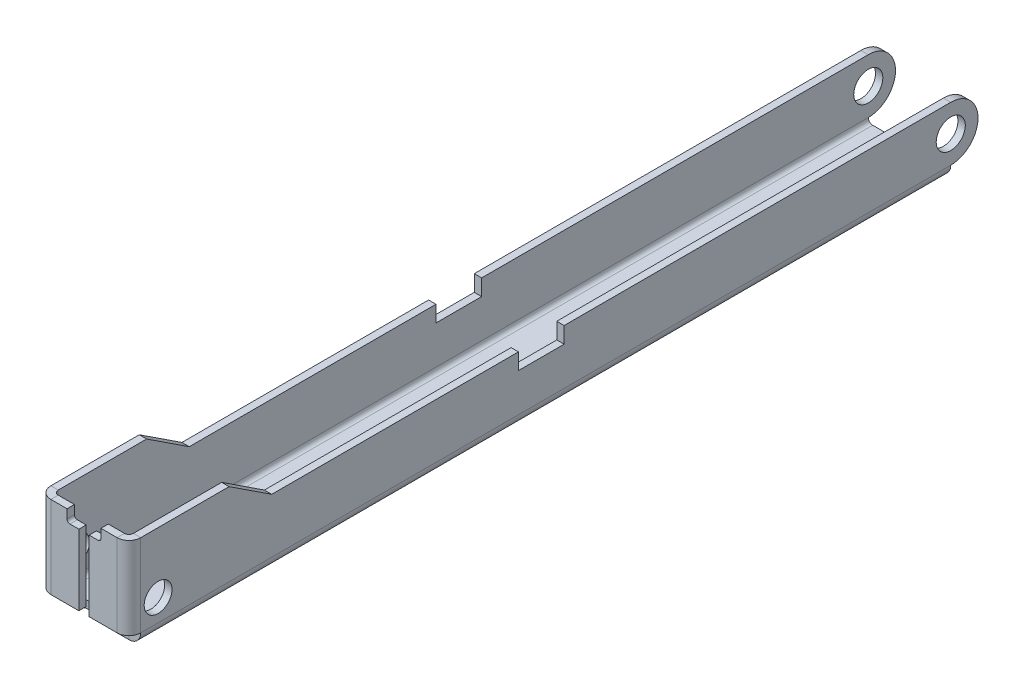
ISO-10303-21;
HEADER;
FILE_DESCRIPTION(('STEP AP214'),'2;1');
FILE_NAME('part.step','',(''),(''),'','','');
FILE_SCHEMA(('AUTOMOTIVE_DESIGN { 1 0 10303 214 1 1 1 1 }'));
ENDSEC;
DATA;
#1=APPLICATION_CONTEXT('core data for automotive mechanical design processes');
#2=APPLICATION_PROTOCOL_DEFINITION('international standard','automotive_design',2000,#1);
#3=PRODUCT_CONTEXT('',#1,'mechanical');
#4=PRODUCT('Part','Part','',(#3));
#5=PRODUCT_RELATED_PRODUCT_CATEGORY('part','',(#4));
#6=PRODUCT_DEFINITION_FORMATION('','',#4);
#7=PRODUCT_DEFINITION_CONTEXT('part definition',#1,'design');
#8=PRODUCT_DEFINITION('design','',#6,#7);
#9=PRODUCT_DEFINITION_SHAPE('','',#8);
#10=(LENGTH_UNIT() NAMED_UNIT(*) SI_UNIT(.MILLI.,.METRE.));
#11=(NAMED_UNIT(*) PLANE_ANGLE_UNIT() SI_UNIT($,.RADIAN.));
#12=(NAMED_UNIT(*) SI_UNIT($,.STERADIAN.) SOLID_ANGLE_UNIT());
#13=UNCERTAINTY_MEASURE_WITH_UNIT(LENGTH_MEASURE(1.E-05),#10,'distance_accuracy_value','');
#14=(GEOMETRIC_REPRESENTATION_CONTEXT(3) GLOBAL_UNCERTAINTY_ASSIGNED_CONTEXT((#13)) GLOBAL_UNIT_ASSIGNED_CONTEXT((#10,
#11,#12)) REPRESENTATION_CONTEXT('',''));
#15=CARTESIAN_POINT('',(0.,0.,0.));
#16=DIRECTION('',(0.,0.,1.));
#17=DIRECTION('',(1.,0.,0.));
#18=AXIS2_PLACEMENT_3D('',#15,#16,#17);
#19=CARTESIAN_POINT('',(6.477,2.03200000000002,139.700000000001));
#20=DIRECTION('',(0.,0.,1.));
#21=DIRECTION('',(1.,0.,0.));
#22=AXIS2_PLACEMENT_3D('',#19,#20,#21);
#23=PLANE('',#22);
#24=DIRECTION('',(1.,0.,0.));
#25=VECTOR('',#24,1.);
#26=CARTESIAN_POINT('',(-7.74700000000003,0.,139.700000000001));
#27=LINE('',#26,#25);
#28=CARTESIAN_POINT('',(-5.715,0.,139.700000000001));
#29=VERTEX_POINT('',#28);
#30=CARTESIAN_POINT('',(-3.429,0.,139.700000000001));
#31=VERTEX_POINT('',#30);
#32=EDGE_CURVE('E388',#29,#31,#27,.T.);
#33=ORIENTED_EDGE('',*,*,#32,.T.);
#34=DIRECTION('',(0.,1.,0.));
#35=VECTOR('',#34,1.);
#36=CARTESIAN_POINT('',(-3.429,1.27000000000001,139.7));
#37=LINE('',#36,#35);
#38=CARTESIAN_POINT('',(-3.429,1.27000000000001,139.7));
#39=VERTEX_POINT('',#38);
#40=EDGE_CURVE('E349',#39,#31,#37,.F.);
#41=ORIENTED_EDGE('',*,*,#40,.F.);
#42=DIRECTION('',(1.,0.,0.));
#43=VECTOR('',#42,1.);
#44=CARTESIAN_POINT('',(-7.74700000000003,1.27000000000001,139.7));
#45=LINE('',#44,#43);
#46=CARTESIAN_POINT('',(-5.715,1.27000000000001,139.7));
#47=VERTEX_POINT('',#46);
#48=EDGE_CURVE('E367',#47,#39,#45,.T.);
#49=ORIENTED_EDGE('',*,*,#48,.F.);
#50=DIRECTION('',(0.,-1.,0.));
#51=VECTOR('',#50,1.);
#52=CARTESIAN_POINT('',(-5.715,1.27000000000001,139.7));
#53=LINE('',#52,#51);
#54=EDGE_CURVE('E773',#47,#29,#53,.T.);
#55=ORIENTED_EDGE('',*,*,#54,.T.);
#56=EDGE_LOOP('',(#33,#41,#49,#55));
#57=FACE_BOUND('',#56,.T.);
#58=ADVANCED_FACE('F73',(#57),#23,.T.);
#59=CARTESIAN_POINT('',(3.429,1.27,139.7));
#60=VERTEX_POINT('',#59);
#61=CARTESIAN_POINT('',(5.715,1.27,139.7));
#62=VERTEX_POINT('',#61);
#63=EDGE_CURVE('E357',#60,#62,#45,.T.);
#64=ORIENTED_EDGE('',*,*,#63,.F.);
#65=DIRECTION('',(0.,1.,0.));
#66=VECTOR('',#65,1.);
#67=CARTESIAN_POINT('',(3.429,1.27,139.7));
#68=LINE('',#67,#66);
#69=CARTESIAN_POINT('',(3.429,0.,139.700000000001));
#70=VERTEX_POINT('',#69);
#71=EDGE_CURVE('E340',#60,#70,#68,.F.);
#72=ORIENTED_EDGE('',*,*,#71,.T.);
#73=CARTESIAN_POINT('',(5.71499999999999,0.,139.700000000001));
#74=VERTEX_POINT('',#73);
#75=EDGE_CURVE('E387',#70,#74,#27,.T.);
#76=ORIENTED_EDGE('',*,*,#75,.T.);
#77=DIRECTION('',(0.,1.,0.));
#78=VECTOR('',#77,1.);
#79=CARTESIAN_POINT('',(5.71499999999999,0.,139.700000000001));
#80=LINE('',#79,#78);
#81=EDGE_CURVE('E365',#74,#62,#80,.T.);
#82=ORIENTED_EDGE('',*,*,#81,.T.);
#83=EDGE_LOOP('',(#64,#72,#76,#82));
#84=FACE_BOUND('',#83,.T.);
#85=ADVANCED_FACE('F363',(#84),#23,.T.);
#86=CARTESIAN_POINT('',(-7.74700000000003,1.27000000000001,139.7));
#87=DIRECTION('',(0.,1.,0.));
#88=DIRECTION('',(0.,0.,1.));
#89=AXIS2_PLACEMENT_3D('',#86,#87,#88);
#90=PLANE('',#89);
#91=CARTESIAN_POINT('',(0.,1.27,117.602000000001));
#92=DIRECTION('',(0.,1.,0.));
#93=DIRECTION('',(0.,0.,1.));
#94=AXIS2_PLACEMENT_3D('',#91,#92,#93);
#95=CIRCLE('',#94,2.47649999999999);
#96=CARTESIAN_POINT('',(0.,1.27,120.078500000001));
#97=VERTEX_POINT('',#96);
#98=EDGE_CURVE('E751',#97,#97,#95,.T.);
#99=ORIENTED_EDGE('',*,*,#98,.F.);
#100=EDGE_LOOP('',(#99));
#101=FACE_BOUND('',#100,.T.);
#102=CARTESIAN_POINT('',(0.,1.27,7.366));
#103=DIRECTION('',(0.,1.,0.));
#104=DIRECTION('',(0.,0.,1.));
#105=AXIS2_PLACEMENT_3D('',#102,#103,#104);
#106=CIRCLE('',#105,2.4765);
#107=CARTESIAN_POINT('',(0.,1.27,9.8425));
#108=VERTEX_POINT('',#107);
#109=EDGE_CURVE('E745',#108,#108,#106,.T.);
#110=ORIENTED_EDGE('',*,*,#109,.F.);
#111=EDGE_LOOP('',(#110));
#112=FACE_BOUND('',#111,.T.);
#113=ORIENTED_EDGE('',*,*,#48,.T.);
#114=DIRECTION('',(-0.529998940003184,0.,0.847998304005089));
#115=VECTOR('',#114,1.);
#116=CARTESIAN_POINT('',(-4.64192134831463,1.27000000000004,141.640674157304));
#117=LINE('',#116,#115);
#118=CARTESIAN_POINT('',(-2.794,1.27,138.684));
#119=VERTEX_POINT('',#118);
#120=EDGE_CURVE('E718',#119,#39,#117,.T.);
#121=ORIENTED_EDGE('',*,*,#120,.F.);
#122=DIRECTION('',(-1.,0.,0.));
#123=VECTOR('',#122,1.);
#124=CARTESIAN_POINT('',(-7.74700000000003,1.27,138.684));
#125=LINE('',#124,#123);
#126=CARTESIAN_POINT('',(2.794,1.27,138.684));
#127=VERTEX_POINT('',#126);
#128=EDGE_CURVE('E360',#127,#119,#125,.T.);
#129=ORIENTED_EDGE('',*,*,#128,.F.);
#130=DIRECTION('',(-0.529998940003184,0.,-0.847998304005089));
#131=VECTOR('',#130,1.);
#132=CARTESIAN_POINT('',(0.28967415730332,1.27,134.677078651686));
#133=LINE('',#132,#131);
#134=EDGE_CURVE('E343',#60,#127,#133,.T.);
#135=ORIENTED_EDGE('',*,*,#134,.F.);
#136=ORIENTED_EDGE('',*,*,#63,.T.);
#137=DIRECTION('',(0.,0.,-1.));
#138=VECTOR('',#137,1.);
#139=CARTESIAN_POINT('',(5.715,1.27,139.7));
#140=LINE('',#139,#138);
#141=CARTESIAN_POINT('',(5.71499999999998,1.27,0.));
#142=VERTEX_POINT('',#141);
#143=EDGE_CURVE('E966',#62,#142,#140,.T.);
#144=ORIENTED_EDGE('',*,*,#143,.T.);
#145=DIRECTION('',(1.,0.,0.));
#146=VECTOR('',#145,1.);
#147=CARTESIAN_POINT('',(-7.747,1.27,0.));
#148=LINE('',#147,#146);
#149=CARTESIAN_POINT('',(-5.71500000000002,1.27,0.));
#150=VERTEX_POINT('',#149);
#151=EDGE_CURVE('E912',#150,#142,#148,.T.);
#152=ORIENTED_EDGE('',*,*,#151,.F.);
#153=DIRECTION('',(0.,0.,-1.));
#154=VECTOR('',#153,1.);
#155=CARTESIAN_POINT('',(-5.715,1.27000000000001,139.7));
#156=LINE('',#155,#154);
#157=EDGE_CURVE('E964',#47,#150,#156,.T.);
#158=ORIENTED_EDGE('',*,*,#157,.F.);
#159=EDGE_LOOP('',(#113,#121,#129,#135,#136,#144,#152,#158));
#160=FACE_BOUND('',#159,.T.);
#161=ADVANCED_FACE('F355',(#101,#112,#160),#90,.T.);
#162=CARTESIAN_POINT('',(-7.74700000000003,0.,139.700000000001));
#163=DIRECTION('',(0.,1.,0.));
#164=DIRECTION('',(0.,0.,1.));
#165=AXIS2_PLACEMENT_3D('',#162,#163,#164);
#166=PLANE('',#165);
#167=CARTESIAN_POINT('',(0.,0.,117.602));
#168=DIRECTION('',(0.,-1.,0.));
#169=DIRECTION('',(0.,0.,-1.));
#170=AXIS2_PLACEMENT_3D('',#167,#168,#169);
#171=CIRCLE('',#170,2.47649999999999);
#172=CARTESIAN_POINT('',(0.,0.,115.1255));
#173=VERTEX_POINT('',#172);
#174=EDGE_CURVE('E754',#173,#173,#171,.T.);
#175=ORIENTED_EDGE('',*,*,#174,.F.);
#176=EDGE_LOOP('',(#175));
#177=FACE_BOUND('',#176,.T.);
#178=CARTESIAN_POINT('',(0.,0.,7.366));
#179=DIRECTION('',(0.,-1.,0.));
#180=DIRECTION('',(0.,0.,-1.));
#181=AXIS2_PLACEMENT_3D('',#178,#179,#180);
#182=CIRCLE('',#181,2.4765);
#183=CARTESIAN_POINT('',(0.,0.,4.88949999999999));
#184=VERTEX_POINT('',#183);
#185=EDGE_CURVE('E748',#184,#184,#182,.T.);
#186=ORIENTED_EDGE('',*,*,#185,.F.);
#187=EDGE_LOOP('',(#186));
#188=FACE_BOUND('',#187,.T.);
#189=DIRECTION('',(-0.529998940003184,0.,0.847998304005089));
#190=VECTOR('',#189,1.);
#191=CARTESIAN_POINT('',(-4.64192134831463,0.,141.640674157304));
#192=LINE('',#191,#190);
#193=CARTESIAN_POINT('',(-2.794,0.,138.684));
#194=VERTEX_POINT('',#193);
#195=EDGE_CURVE('E350',#194,#31,#192,.T.);
#196=ORIENTED_EDGE('',*,*,#195,.T.);
#197=ORIENTED_EDGE('',*,*,#32,.F.);
#198=DIRECTION('',(0.,0.,-1.));
#199=VECTOR('',#198,1.);
#200=CARTESIAN_POINT('',(-5.715,0.,139.700000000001));
#201=LINE('',#200,#199);
#202=CARTESIAN_POINT('',(-5.71500000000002,0.,0.));
#203=VERTEX_POINT('',#202);
#204=EDGE_CURVE('E399',#29,#203,#201,.T.);
#205=ORIENTED_EDGE('',*,*,#204,.T.);
#206=DIRECTION('',(1.,0.,0.));
#207=VECTOR('',#206,1.);
#208=CARTESIAN_POINT('',(-7.747,0.,0.));
#209=LINE('',#208,#207);
#210=CARTESIAN_POINT('',(5.71499999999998,0.,0.));
#211=VERTEX_POINT('',#210);
#212=EDGE_CURVE('E792',#203,#211,#209,.T.);
#213=ORIENTED_EDGE('',*,*,#212,.T.);
#214=DIRECTION('',(0.,0.,-1.));
#215=VECTOR('',#214,1.);
#216=CARTESIAN_POINT('',(5.71499999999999,0.,139.700000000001));
#217=LINE('',#216,#215);
#218=EDGE_CURVE('E396',#74,#211,#217,.T.);
#219=ORIENTED_EDGE('',*,*,#218,.F.);
#220=ORIENTED_EDGE('',*,*,#75,.F.);
#221=DIRECTION('',(-0.529998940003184,0.,-0.847998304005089));
#222=VECTOR('',#221,1.);
#223=CARTESIAN_POINT('',(0.28967415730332,0.,134.677078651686));
#224=LINE('',#223,#222);
#225=CARTESIAN_POINT('',(2.79400000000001,0.,138.684));
#226=VERTEX_POINT('',#225);
#227=EDGE_CURVE('E345',#70,#226,#224,.T.);
#228=ORIENTED_EDGE('',*,*,#227,.T.);
#229=DIRECTION('',(1.,0.,0.));
#230=VECTOR('',#229,1.);
#231=CARTESIAN_POINT('',(-7.74700000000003,0.,138.684));
#232=LINE('',#231,#230);
#233=EDGE_CURVE('E717',#226,#194,#232,.F.);
#234=ORIENTED_EDGE('',*,*,#233,.T.);
#235=EDGE_LOOP('',(#196,#197,#205,#213,#219,#220,#228,#234));
#236=FACE_BOUND('',#235,.T.);
#237=ADVANCED_FACE('F760',(#177,#188,#236),#166,.F.);
#238=CARTESIAN_POINT('',(6.47699999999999,11.4300000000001,139.700000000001));
#239=DIRECTION('',(0.,1.,0.));
#240=DIRECTION('',(0.,0.,1.));
#241=AXIS2_PLACEMENT_3D('',#238,#239,#240);
#242=PLANE('',#241);
#243=DIRECTION('',(1.,0.,0.));
#244=VECTOR('',#243,1.);
#245=CARTESIAN_POINT('',(-7.747,11.4300000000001,66.6750000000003));
#246=LINE('',#245,#244);
#247=CARTESIAN_POINT('',(6.47699999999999,11.4300000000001,66.6750000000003));
#248=VERTEX_POINT('',#247);
#249=CARTESIAN_POINT('',(7.74699999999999,11.4300000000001,66.6750000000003));
#250=VERTEX_POINT('',#249);
#251=EDGE_CURVE('E568',#248,#250,#246,.T.);
#252=ORIENTED_EDGE('',*,*,#251,.T.);
#253=DIRECTION('',(0.,0.,-1.));
#254=VECTOR('',#253,1.);
#255=CARTESIAN_POINT('',(7.74699999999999,11.4300000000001,139.700000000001));
#256=LINE('',#255,#254);
#257=CARTESIAN_POINT('',(7.74699999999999,11.4300000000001,0.));
#258=VERTEX_POINT('',#257);
#259=EDGE_CURVE('E427',#250,#258,#256,.T.);
#260=ORIENTED_EDGE('',*,*,#259,.T.);
#261=DIRECTION('',(1.,0.,0.));
#262=VECTOR('',#261,1.);
#263=CARTESIAN_POINT('',(6.47699999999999,11.4300000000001,0.));
#264=LINE('',#263,#262);
#265=CARTESIAN_POINT('',(6.47699999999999,11.4300000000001,0.));
#266=VERTEX_POINT('',#265);
#267=EDGE_CURVE('E514',#266,#258,#264,.T.);
#268=ORIENTED_EDGE('',*,*,#267,.F.);
#269=DIRECTION('',(0.,0.,-1.));
#270=VECTOR('',#269,1.);
#271=CARTESIAN_POINT('',(6.47699999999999,11.4300000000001,139.700000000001));
#272=LINE('',#271,#270);
#273=EDGE_CURVE('E422',#248,#266,#272,.T.);
#274=ORIENTED_EDGE('',*,*,#273,.F.);
#275=EDGE_LOOP('',(#252,#260,#268,#274));
#276=FACE_BOUND('',#275,.T.);
#277=ADVANCED_FACE('F763',(#276),#242,.T.);
#278=CARTESIAN_POINT('',(-7.74700000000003,11.4300000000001,139.700000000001));
#279=DIRECTION('',(0.,1.,0.));
#280=DIRECTION('',(0.,0.,1.));
#281=AXIS2_PLACEMENT_3D('',#278,#279,#280);
#282=PLANE('',#281);
#283=CARTESIAN_POINT('',(-7.747,11.4300000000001,66.6750000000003));
#284=VERTEX_POINT('',#283);
#285=CARTESIAN_POINT('',(-6.47700000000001,11.4300000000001,66.6750000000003));
#286=VERTEX_POINT('',#285);
#287=EDGE_CURVE('E564',#284,#286,#246,.T.);
#288=ORIENTED_EDGE('',*,*,#287,.T.);
#289=DIRECTION('',(0.,0.,-1.));
#290=VECTOR('',#289,1.);
#291=CARTESIAN_POINT('',(-6.47700000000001,11.4300000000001,139.700000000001));
#292=LINE('',#291,#290);
#293=CARTESIAN_POINT('',(-6.47700000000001,11.4300000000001,0.));
#294=VERTEX_POINT('',#293);
#295=EDGE_CURVE('E419',#286,#294,#292,.T.);
#296=ORIENTED_EDGE('',*,*,#295,.T.);
#297=DIRECTION('',(1.,0.,0.));
#298=VECTOR('',#297,1.);
#299=CARTESIAN_POINT('',(-7.74700000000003,11.4300000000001,0.));
#300=LINE('',#299,#298);
#301=CARTESIAN_POINT('',(-7.74700000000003,11.4300000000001,0.));
#302=VERTEX_POINT('',#301);
#303=EDGE_CURVE('E802',#302,#294,#300,.T.);
#304=ORIENTED_EDGE('',*,*,#303,.F.);
#305=DIRECTION('',(0.,0.,-1.));
#306=VECTOR('',#305,1.);
#307=CARTESIAN_POINT('',(-7.74700000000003,11.4300000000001,139.700000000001));
#308=LINE('',#307,#306);
#309=EDGE_CURVE('E404',#284,#302,#308,.T.);
#310=ORIENTED_EDGE('',*,*,#309,.F.);
#311=EDGE_LOOP('',(#288,#296,#304,#310));
#312=FACE_BOUND('',#311,.T.);
#313=ADVANCED_FACE('F928',(#312),#282,.T.);
#314=DIRECTION('',(1.,0.,0.));
#315=VECTOR('',#314,1.);
#316=CARTESIAN_POINT('',(-7.747,11.43,74.5490000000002));
#317=LINE('',#316,#315);
#318=CARTESIAN_POINT('',(6.477,11.43,74.5490000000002));
#319=VERTEX_POINT('',#318);
#320=CARTESIAN_POINT('',(7.747,11.43,74.5490000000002));
#321=VERTEX_POINT('',#320);
#322=EDGE_CURVE('E546',#319,#321,#317,.T.);
#323=ORIENTED_EDGE('',*,*,#322,.F.);
#324=CARTESIAN_POINT('',(6.47699999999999,11.43,117.094000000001));
#325=VERTEX_POINT('',#324);
#326=EDGE_CURVE('E425',#325,#319,#272,.T.);
#327=ORIENTED_EDGE('',*,*,#326,.F.);
#328=DIRECTION('',(1.,0.,0.));
#329=VECTOR('',#328,1.);
#330=CARTESIAN_POINT('',(6.47699999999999,11.43,117.094000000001));
#331=LINE('',#330,#329);
#332=CARTESIAN_POINT('',(7.74699999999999,11.43,117.094));
#333=VERTEX_POINT('',#332);
#334=EDGE_CURVE('E452',#325,#333,#331,.T.);
#335=ORIENTED_EDGE('',*,*,#334,.T.);
#336=EDGE_CURVE('E441',#333,#321,#256,.T.);
#337=ORIENTED_EDGE('',*,*,#336,.T.);
#338=EDGE_LOOP('',(#323,#327,#335,#337));
#339=FACE_BOUND('',#338,.T.);
#340=ADVANCED_FACE('F662',(#339),#242,.T.);
#341=CARTESIAN_POINT('',(-7.747,11.43,74.5490000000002));
#342=VERTEX_POINT('',#341);
#343=CARTESIAN_POINT('',(-6.477,11.43,74.5490000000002));
#344=VERTEX_POINT('',#343);
#345=EDGE_CURVE('E542',#342,#344,#317,.T.);
#346=ORIENTED_EDGE('',*,*,#345,.F.);
#347=CARTESIAN_POINT('',(-7.74700000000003,11.43,117.094));
#348=VERTEX_POINT('',#347);
#349=EDGE_CURVE('E411',#348,#342,#308,.T.);
#350=ORIENTED_EDGE('',*,*,#349,.F.);
#351=DIRECTION('',(1.,0.,0.));
#352=VECTOR('',#351,1.);
#353=CARTESIAN_POINT('',(-7.74700000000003,11.43,117.094));
#354=LINE('',#353,#352);
#355=CARTESIAN_POINT('',(-6.47700000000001,11.43,117.094));
#356=VERTEX_POINT('',#355);
#357=EDGE_CURVE('E511',#348,#356,#354,.T.);
#358=ORIENTED_EDGE('',*,*,#357,.T.);
#359=EDGE_CURVE('E421',#356,#344,#292,.T.);
#360=ORIENTED_EDGE('',*,*,#359,.T.);
#361=EDGE_LOOP('',(#346,#350,#358,#360));
#362=FACE_BOUND('',#361,.T.);
#363=ADVANCED_FACE('F539',(#362),#282,.T.);
#364=CARTESIAN_POINT('',(-7.74700000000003,2.03200000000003,139.700000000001));
#365=DIRECTION('',(0.,0.,1.));
#366=DIRECTION('',(1.,0.,0.));
#367=AXIS2_PLACEMENT_3D('',#364,#365,#366);
#368=PLANE('',#367);
#369=DIRECTION('',(1.,0.,0.));
#370=VECTOR('',#369,1.);
#371=CARTESIAN_POINT('',(-7.74700000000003,2.03200000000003,139.700000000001));
#372=LINE('',#371,#370);
#373=CARTESIAN_POINT('',(-7.74700000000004,2.03200000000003,139.700000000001));
#374=VERTEX_POINT('',#373);
#375=CARTESIAN_POINT('',(-6.477,2.03200000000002,139.700000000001));
#376=VERTEX_POINT('',#375);
#377=EDGE_CURVE('E777',#374,#376,#372,.T.);
#378=ORIENTED_EDGE('',*,*,#377,.F.);
#379=CARTESIAN_POINT('',(-5.715,2.03200000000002,139.700000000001));
#380=DIRECTION('',(0.,0.,-1.));
#381=DIRECTION('',(-1.,0.,0.));
#382=AXIS2_PLACEMENT_3D('',#379,#380,#381);
#383=CIRCLE('',#382,2.032);
#384=EDGE_CURVE('E384',#374,#29,#383,.F.);
#385=ORIENTED_EDGE('',*,*,#384,.T.);
#386=ORIENTED_EDGE('',*,*,#54,.F.);
#387=CARTESIAN_POINT('',(-5.715,2.03200000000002,139.700000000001));
#388=DIRECTION('',(0.,0.,1.));
#389=DIRECTION('',(1.,0.,0.));
#390=AXIS2_PLACEMENT_3D('',#387,#388,#389);
#391=CIRCLE('',#390,0.762);
#392=EDGE_CURVE('E370',#376,#47,#391,.T.);
#393=ORIENTED_EDGE('',*,*,#392,.F.);
#394=EDGE_LOOP('',(#378,#385,#386,#393));
#395=FACE_BOUND('',#394,.T.);
#396=ADVANCED_FACE('F75',(#395),#368,.T.);
#397=CARTESIAN_POINT('',(-5.71500000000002,0.,0.));
#398=DIRECTION('',(0.,0.,-1.));
#399=DIRECTION('',(-1.,0.,0.));
#400=AXIS2_PLACEMENT_3D('',#397,#398,#399);
#401=PLANE('',#400);
#402=DIRECTION('',(0.,1.,0.));
#403=VECTOR('',#402,1.);
#404=CARTESIAN_POINT('',(-5.71500000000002,0.,0.));
#405=LINE('',#404,#403);
#406=EDGE_CURVE('E778',#203,#150,#405,.T.);
#407=ORIENTED_EDGE('',*,*,#406,.F.);
#408=CARTESIAN_POINT('',(-5.71500000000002,2.03200000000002,0.));
#409=DIRECTION('',(0.,0.,-1.));
#410=DIRECTION('',(-1.,0.,0.));
#411=AXIS2_PLACEMENT_3D('',#408,#409,#410);
#412=CIRCLE('',#411,2.032);
#413=CARTESIAN_POINT('',(-7.747,2.03200000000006,0.));
#414=VERTEX_POINT('',#413);
#415=EDGE_CURVE('E788',#414,#203,#412,.F.);
#416=ORIENTED_EDGE('',*,*,#415,.F.);
#417=DIRECTION('',(-1.,0.,0.));
#418=VECTOR('',#417,1.);
#419=CARTESIAN_POINT('',(-6.47700000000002,2.03200000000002,0.));
#420=LINE('',#419,#418);
#421=CARTESIAN_POINT('',(-6.47700000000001,2.03200000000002,0.));
#422=VERTEX_POINT('',#421);
#423=EDGE_CURVE('E891',#422,#414,#420,.T.);
#424=ORIENTED_EDGE('',*,*,#423,.F.);
#425=CARTESIAN_POINT('',(-5.71500000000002,2.03200000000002,0.));
#426=DIRECTION('',(0.,0.,1.));
#427=DIRECTION('',(1.,0.,0.));
#428=AXIS2_PLACEMENT_3D('',#425,#426,#427);
#429=CIRCLE('',#428,0.762);
#430=EDGE_CURVE('E914',#422,#150,#429,.T.);
#431=ORIENTED_EDGE('',*,*,#430,.T.);
#432=EDGE_LOOP('',(#407,#416,#424,#431));
#433=FACE_BOUND('',#432,.T.);
#434=ADVANCED_FACE('F956',(#433),#401,.T.);
#435=CARTESIAN_POINT('',(-6.47700000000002,2.03200000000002,0.));
#436=DIRECTION('',(0.,0.,-1.));
#437=DIRECTION('',(-1.,0.,0.));
#438=AXIS2_PLACEMENT_3D('',#435,#436,#437);
#439=PLANE('',#438);
#440=ORIENTED_EDGE('',*,*,#212,.F.);
#441=ORIENTED_EDGE('',*,*,#406,.T.);
#442=ORIENTED_EDGE('',*,*,#151,.T.);
#443=DIRECTION('',(0.,-1.,0.));
#444=VECTOR('',#443,1.);
#445=CARTESIAN_POINT('',(5.71499999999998,1.27,0.));
#446=LINE('',#445,#444);
#447=EDGE_CURVE('E444',#142,#211,#446,.T.);
#448=ORIENTED_EDGE('',*,*,#447,.T.);
#449=EDGE_LOOP('',(#440,#441,#442,#448));
#450=FACE_BOUND('',#449,.T.);
#451=ADVANCED_FACE('F794',(#450),#439,.T.);
#452=CARTESIAN_POINT('',(5.71499999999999,0.,139.700000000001));
#453=DIRECTION('',(0.,0.,1.));
#454=DIRECTION('',(1.,0.,0.));
#455=AXIS2_PLACEMENT_3D('',#452,#453,#454);
#456=PLANE('',#455);
#457=ORIENTED_EDGE('',*,*,#81,.F.);
#458=CARTESIAN_POINT('',(5.715,2.03200000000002,139.700000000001));
#459=DIRECTION('',(0.,0.,-1.));
#460=DIRECTION('',(-1.,0.,0.));
#461=AXIS2_PLACEMENT_3D('',#458,#459,#460);
#462=CIRCLE('',#461,2.032);
#463=CARTESIAN_POINT('',(7.747,2.03200000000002,139.700000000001));
#464=VERTEX_POINT('',#463);
#465=EDGE_CURVE('E391',#74,#464,#462,.F.);
#466=ORIENTED_EDGE('',*,*,#465,.T.);
#467=DIRECTION('',(1.,0.,0.));
#468=VECTOR('',#467,1.);
#469=CARTESIAN_POINT('',(6.477,2.03200000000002,139.700000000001));
#470=LINE('',#469,#468);
#471=CARTESIAN_POINT('',(6.477,2.03200000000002,139.700000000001));
#472=VERTEX_POINT('',#471);
#473=EDGE_CURVE('E895',#472,#464,#470,.T.);
#474=ORIENTED_EDGE('',*,*,#473,.F.);
#475=CARTESIAN_POINT('',(5.715,2.03200000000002,139.700000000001));
#476=DIRECTION('',(0.,0.,1.));
#477=DIRECTION('',(1.,0.,0.));
#478=AXIS2_PLACEMENT_3D('',#475,#476,#477);
#479=CIRCLE('',#478,0.762);
#480=EDGE_CURVE('E368',#62,#472,#479,.T.);
#481=ORIENTED_EDGE('',*,*,#480,.F.);
#482=EDGE_LOOP('',(#457,#466,#474,#481));
#483=FACE_BOUND('',#482,.T.);
#484=ADVANCED_FACE('F951',(#483),#456,.T.);
#485=CARTESIAN_POINT('',(7.74699999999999,2.032,0.));
#486=DIRECTION('',(0.,0.,-1.));
#487=DIRECTION('',(-1.,0.,0.));
#488=AXIS2_PLACEMENT_3D('',#485,#486,#487);
#489=PLANE('',#488);
#490=DIRECTION('',(-1.,0.,0.));
#491=VECTOR('',#490,1.);
#492=CARTESIAN_POINT('',(7.74699999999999,2.032,0.));
#493=LINE('',#492,#491);
#494=CARTESIAN_POINT('',(7.74699999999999,2.032,0.));
#495=VERTEX_POINT('',#494);
#496=CARTESIAN_POINT('',(6.47699999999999,2.03200000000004,0.));
#497=VERTEX_POINT('',#496);
#498=EDGE_CURVE('E898',#495,#497,#493,.T.);
#499=ORIENTED_EDGE('',*,*,#498,.F.);
#500=CARTESIAN_POINT('',(5.71499999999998,2.03200000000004,0.));
#501=DIRECTION('',(0.,0.,-1.));
#502=DIRECTION('',(-1.,0.,0.));
#503=AXIS2_PLACEMENT_3D('',#500,#501,#502);
#504=CIRCLE('',#503,2.032);
#505=EDGE_CURVE('E797',#211,#495,#504,.F.);
#506=ORIENTED_EDGE('',*,*,#505,.F.);
#507=ORIENTED_EDGE('',*,*,#447,.F.);
#508=CARTESIAN_POINT('',(5.71499999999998,2.03200000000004,0.));
#509=DIRECTION('',(0.,0.,1.));
#510=DIRECTION('',(1.,0.,0.));
#511=AXIS2_PLACEMENT_3D('',#508,#509,#510);
#512=CIRCLE('',#511,0.762);
#513=EDGE_CURVE('E911',#142,#497,#512,.T.);
#514=ORIENTED_EDGE('',*,*,#513,.T.);
#515=EDGE_LOOP('',(#499,#506,#507,#514));
#516=FACE_BOUND('',#515,.T.);
#517=ADVANCED_FACE('F949',(#516),#489,.T.);
#518=CARTESIAN_POINT('',(7.747,0.,139.700000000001));
#519=DIRECTION('',(-1.,0.,0.));
#520=DIRECTION('',(0.,0.,1.));
#521=AXIS2_PLACEMENT_3D('',#518,#519,#520);
#522=PLANE('',#521);
#523=CARTESIAN_POINT('',(7.747,5.830733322,136.696570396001));
#524=DIRECTION('',(1.,0.,0.));
#525=DIRECTION('',(0.,0.,-1.));
#526=AXIS2_PLACEMENT_3D('',#523,#524,#525);
#527=CIRCLE('',#526,2.40089512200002);
#528=CARTESIAN_POINT('',(7.747,5.830733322,134.295675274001));
#529=VERTEX_POINT('',#528);
#530=EDGE_CURVE('E742',#529,#529,#527,.T.);
#531=ORIENTED_EDGE('',*,*,#530,.F.);
#532=EDGE_LOOP('',(#531));
#533=FACE_BOUND('',#532,.T.);
#534=CARTESIAN_POINT('',(7.74699999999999,6.731,0.));
#535=DIRECTION('',(-1.,0.,0.));
#536=DIRECTION('',(0.,0.,1.));
#537=AXIS2_PLACEMENT_3D('',#534,#535,#536);
#538=CIRCLE('',#537,2.507907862);
#539=CARTESIAN_POINT('',(7.74699999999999,6.731,2.50790786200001));
#540=VERTEX_POINT('',#539);
#541=EDGE_CURVE('E361',#540,#540,#538,.T.);
#542=ORIENTED_EDGE('',*,*,#541,.T.);
#543=EDGE_LOOP('',(#542));
#544=FACE_BOUND('',#543,.T.);
#545=ORIENTED_EDGE('',*,*,#259,.F.);
#546=DIRECTION('',(0.,-1.,0.));
#547=VECTOR('',#546,1.);
#548=CARTESIAN_POINT('',(7.74699999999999,0.,66.6750000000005));
#549=LINE('',#548,#547);
#550=CARTESIAN_POINT('',(7.74699999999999,8.63600000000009,66.6750000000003));
#551=VERTEX_POINT('',#550);
#552=EDGE_CURVE('E587',#250,#551,#549,.T.);
#553=ORIENTED_EDGE('',*,*,#552,.T.);
#554=DIRECTION('',(0.,0.,1.));
#555=VECTOR('',#554,1.);
#556=CARTESIAN_POINT('',(7.747,8.63600000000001,139.700000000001));
#557=LINE('',#556,#555);
#558=CARTESIAN_POINT('',(7.747,8.63599999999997,74.5490000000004));
#559=VERTEX_POINT('',#558);
#560=EDGE_CURVE('E580',#551,#559,#557,.T.);
#561=ORIENTED_EDGE('',*,*,#560,.T.);
#562=DIRECTION('',(0.,1.,0.));
#563=VECTOR('',#562,1.);
#564=CARTESIAN_POINT('',(7.747,0.,74.5490000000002));
#565=LINE('',#564,#563);
#566=EDGE_CURVE('E573',#559,#321,#565,.T.);
#567=ORIENTED_EDGE('',*,*,#566,.T.);
#568=ORIENTED_EDGE('',*,*,#336,.F.);
#569=DIRECTION('',(0.,0.548026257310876,0.836461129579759));
#570=VECTOR('',#569,1.);
#571=CARTESIAN_POINT('',(7.747,16.256,124.460000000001));
#572=LINE('',#571,#570);
#573=CARTESIAN_POINT('',(7.747,16.256,124.460000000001));
#574=VERTEX_POINT('',#573);
#575=EDGE_CURVE('E445',#333,#574,#572,.T.);
#576=ORIENTED_EDGE('',*,*,#575,.T.);
#577=DIRECTION('',(0.,0.,1.));
#578=VECTOR('',#577,1.);
#579=CARTESIAN_POINT('',(7.747,16.256,139.7));
#580=LINE('',#579,#578);
#581=CARTESIAN_POINT('',(7.74700000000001,16.256,139.7));
#582=VERTEX_POINT('',#581);
#583=EDGE_CURVE('E448',#574,#582,#580,.T.);
#584=ORIENTED_EDGE('',*,*,#583,.T.);
#585=DIRECTION('',(0.,1.,0.));
#586=VECTOR('',#585,1.);
#587=CARTESIAN_POINT('',(7.747,0.,139.700000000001));
#588=LINE('',#587,#586);
#589=EDGE_CURVE('E800',#464,#582,#588,.T.);
#590=ORIENTED_EDGE('',*,*,#589,.F.);
#591=DIRECTION('',(0.,0.,-1.));
#592=VECTOR('',#591,1.);
#593=CARTESIAN_POINT('',(7.747,2.03200000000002,139.700000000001));
#594=LINE('',#593,#592);
#595=EDGE_CURVE('E393',#464,#495,#594,.T.);
#596=ORIENTED_EDGE('',*,*,#595,.T.);
#597=CARTESIAN_POINT('',(7.74699999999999,6.731,0.));
#598=DIRECTION('',(1.,0.,0.));
#599=DIRECTION('',(0.,0.,1.));
#600=AXIS2_PLACEMENT_3D('',#597,#598,#599);
#601=CIRCLE('',#600,4.699);
#602=EDGE_CURVE('E589',#495,#258,#601,.T.);
#603=ORIENTED_EDGE('',*,*,#602,.T.);
#604=EDGE_LOOP('',(#545,#553,#561,#567,#568,#576,#584,#590,#596,#603));
#605=FACE_BOUND('',#604,.T.);
#606=ADVANCED_FACE('F658',(#533,#544,#605),#522,.F.);
#607=CARTESIAN_POINT('',(6.477,0.,139.700000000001));
#608=DIRECTION('',(-1.,0.,0.));
#609=DIRECTION('',(0.,0.,1.));
#610=AXIS2_PLACEMENT_3D('',#607,#608,#609);
#611=PLANE('',#610);
#612=CARTESIAN_POINT('',(6.477,5.830733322,136.696570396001));
#613=DIRECTION('',(-1.,0.,0.));
#614=DIRECTION('',(0.,0.,1.));
#615=AXIS2_PLACEMENT_3D('',#612,#613,#614);
#616=CIRCLE('',#615,2.40089512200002);
#617=CARTESIAN_POINT('',(6.477,5.830733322,139.097465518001));
#618=VERTEX_POINT('',#617);
#619=EDGE_CURVE('E736',#618,#618,#616,.T.);
#620=ORIENTED_EDGE('',*,*,#619,.F.);
#621=EDGE_LOOP('',(#620));
#622=FACE_BOUND('',#621,.T.);
#623=CARTESIAN_POINT('',(6.47699999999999,6.731,0.));
#624=DIRECTION('',(-1.,0.,0.));
#625=DIRECTION('',(0.,0.,1.));
#626=AXIS2_PLACEMENT_3D('',#623,#624,#625);
#627=CIRCLE('',#626,2.507907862);
#628=CARTESIAN_POINT('',(6.47699999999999,6.731,2.50790786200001));
#629=VERTEX_POINT('',#628);
#630=EDGE_CURVE('E727',#629,#629,#627,.T.);
#631=ORIENTED_EDGE('',*,*,#630,.F.);
#632=EDGE_LOOP('',(#631));
#633=FACE_BOUND('',#632,.T.);
#634=DIRECTION('',(0.,-1.,0.));
#635=VECTOR('',#634,1.);
#636=CARTESIAN_POINT('',(6.47699999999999,0.,66.6750000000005));
#637=LINE('',#636,#635);
#638=CARTESIAN_POINT('',(6.47699999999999,8.63600000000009,66.6750000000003));
#639=VERTEX_POINT('',#638);
#640=EDGE_CURVE('E584',#248,#639,#637,.T.);
#641=ORIENTED_EDGE('',*,*,#640,.F.);
#642=ORIENTED_EDGE('',*,*,#273,.T.);
#643=CARTESIAN_POINT('',(6.47699999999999,6.731,0.));
#644=DIRECTION('',(1.,0.,0.));
#645=DIRECTION('',(0.,0.,1.));
#646=AXIS2_PLACEMENT_3D('',#643,#644,#645);
#647=CIRCLE('',#646,4.699);
#648=EDGE_CURVE('E592',#497,#266,#647,.T.);
#649=ORIENTED_EDGE('',*,*,#648,.F.);
#650=DIRECTION('',(0.,0.,-1.));
#651=VECTOR('',#650,1.);
#652=CARTESIAN_POINT('',(6.477,2.03200000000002,139.700000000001));
#653=LINE('',#652,#651);
#654=EDGE_CURVE('E426',#472,#497,#653,.T.);
#655=ORIENTED_EDGE('',*,*,#654,.F.);
#656=DIRECTION('',(0.,1.,0.));
#657=VECTOR('',#656,1.);
#658=CARTESIAN_POINT('',(6.477,0.,139.700000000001));
#659=LINE('',#658,#657);
#660=CARTESIAN_POINT('',(6.477,16.256,139.7));
#661=VERTEX_POINT('',#660);
#662=EDGE_CURVE('E372',#472,#661,#659,.T.);
#663=ORIENTED_EDGE('',*,*,#662,.T.);
#664=DIRECTION('',(0.,0.,1.));
#665=VECTOR('',#664,1.);
#666=CARTESIAN_POINT('',(6.477,16.256,139.7));
#667=LINE('',#666,#665);
#668=CARTESIAN_POINT('',(6.477,16.256,124.460000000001));
#669=VERTEX_POINT('',#668);
#670=EDGE_CURVE('E456',#669,#661,#667,.T.);
#671=ORIENTED_EDGE('',*,*,#670,.F.);
#672=DIRECTION('',(0.,0.548026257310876,0.836461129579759));
#673=VECTOR('',#672,1.);
#674=CARTESIAN_POINT('',(6.477,16.256,124.460000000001));
#675=LINE('',#674,#673);
#676=EDGE_CURVE('E457',#325,#669,#675,.T.);
#677=ORIENTED_EDGE('',*,*,#676,.F.);
#678=ORIENTED_EDGE('',*,*,#326,.T.);
#679=DIRECTION('',(0.,1.,0.));
#680=VECTOR('',#679,1.);
#681=CARTESIAN_POINT('',(6.477,0.,74.5490000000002));
#682=LINE('',#681,#680);
#683=CARTESIAN_POINT('',(6.477,8.63599999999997,74.5490000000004));
#684=VERTEX_POINT('',#683);
#685=EDGE_CURVE('E570',#684,#319,#682,.T.);
#686=ORIENTED_EDGE('',*,*,#685,.F.);
#687=DIRECTION('',(0.,0.,1.));
#688=VECTOR('',#687,1.);
#689=CARTESIAN_POINT('',(6.477,8.63600000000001,139.700000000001));
#690=LINE('',#689,#688);
#691=EDGE_CURVE('E577',#639,#684,#690,.T.);
#692=ORIENTED_EDGE('',*,*,#691,.F.);
#693=EDGE_LOOP('',(#641,#642,#649,#655,#663,#671,#677,#678,#686,#692));
#694=FACE_BOUND('',#693,.T.);
#695=ADVANCED_FACE('F669',(#622,#633,#694),#611,.T.);
#696=CARTESIAN_POINT('',(5.715,2.03200000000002,139.700000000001));
#697=DIRECTION('',(0.,0.,-1.));
#698=DIRECTION('',(-1.,0.,0.));
#699=AXIS2_PLACEMENT_3D('',#696,#697,#698);
#700=CYLINDRICAL_SURFACE('',#699,0.762);
#701=ORIENTED_EDGE('',*,*,#513,.F.);
#702=ORIENTED_EDGE('',*,*,#143,.F.);
#703=ORIENTED_EDGE('',*,*,#480,.T.);
#704=ORIENTED_EDGE('',*,*,#654,.T.);
#705=EDGE_LOOP('',(#701,#702,#703,#704));
#706=FACE_BOUND('',#705,.T.);
#707=ADVANCED_FACE('F970',(#706),#700,.F.);
#708=CARTESIAN_POINT('',(-5.715,2.03200000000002,139.700000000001));
#709=DIRECTION('',(0.,0.,-1.));
#710=DIRECTION('',(-1.,0.,0.));
#711=AXIS2_PLACEMENT_3D('',#708,#709,#710);
#712=CYLINDRICAL_SURFACE('',#711,0.762);
#713=ORIENTED_EDGE('',*,*,#430,.F.);
#714=DIRECTION('',(0.,0.,-1.));
#715=VECTOR('',#714,1.);
#716=CARTESIAN_POINT('',(-6.477,2.03200000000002,139.700000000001));
#717=LINE('',#716,#715);
#718=EDGE_CURVE('E883',#376,#422,#717,.T.);
#719=ORIENTED_EDGE('',*,*,#718,.F.);
#720=ORIENTED_EDGE('',*,*,#392,.T.);
#721=ORIENTED_EDGE('',*,*,#157,.T.);
#722=EDGE_LOOP('',(#713,#719,#720,#721));
#723=FACE_BOUND('',#722,.T.);
#724=ADVANCED_FACE('F963',(#723),#712,.F.);
#725=CARTESIAN_POINT('',(-6.47700000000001,11.4300000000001,139.700000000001));
#726=DIRECTION('',(1.,0.,0.));
#727=DIRECTION('',(0.,0.,-1.));
#728=AXIS2_PLACEMENT_3D('',#725,#726,#727);
#729=PLANE('',#728);
#730=CARTESIAN_POINT('',(-6.477,5.830733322,136.696570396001));
#731=DIRECTION('',(1.,0.,0.));
#732=DIRECTION('',(0.,0.,-1.));
#733=AXIS2_PLACEMENT_3D('',#730,#731,#732);
#734=CIRCLE('',#733,2.40089512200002);
#735=CARTESIAN_POINT('',(-6.477,5.830733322,134.295675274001));
#736=VERTEX_POINT('',#735);
#737=EDGE_CURVE('E739',#736,#736,#734,.T.);
#738=ORIENTED_EDGE('',*,*,#737,.F.);
#739=EDGE_LOOP('',(#738));
#740=FACE_BOUND('',#739,.T.);
#741=CARTESIAN_POINT('',(-6.47700000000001,6.731,0.));
#742=DIRECTION('',(1.,0.,0.));
#743=DIRECTION('',(0.,0.,-1.));
#744=AXIS2_PLACEMENT_3D('',#741,#742,#743);
#745=CIRCLE('',#744,2.507907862);
#746=CARTESIAN_POINT('',(-6.47700000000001,6.731,-2.50790786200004));
#747=VERTEX_POINT('',#746);
#748=EDGE_CURVE('E730',#747,#747,#745,.T.);
#749=ORIENTED_EDGE('',*,*,#748,.F.);
#750=EDGE_LOOP('',(#749));
#751=FACE_BOUND('',#750,.T.);
#752=DIRECTION('',(0.,1.,0.));
#753=VECTOR('',#752,1.);
#754=CARTESIAN_POINT('',(-6.47700000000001,11.4300000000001,66.6750000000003));
#755=LINE('',#754,#753);
#756=CARTESIAN_POINT('',(-6.47700000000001,8.63600000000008,66.6750000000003));
#757=VERTEX_POINT('',#756);
#758=EDGE_CURVE('E582',#757,#286,#755,.T.);
#759=ORIENTED_EDGE('',*,*,#758,.F.);
#760=DIRECTION('',(0.,0.,-1.));
#761=VECTOR('',#760,1.);
#762=CARTESIAN_POINT('',(-6.477,8.63600000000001,139.700000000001));
#763=LINE('',#762,#761);
#764=CARTESIAN_POINT('',(-6.477,8.63599999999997,74.5490000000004));
#765=VERTEX_POINT('',#764);
#766=EDGE_CURVE('E575',#765,#757,#763,.T.);
#767=ORIENTED_EDGE('',*,*,#766,.F.);
#768=DIRECTION('',(0.,-1.,0.));
#769=VECTOR('',#768,1.);
#770=CARTESIAN_POINT('',(-6.477,11.43,74.5490000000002));
#771=LINE('',#770,#769);
#772=EDGE_CURVE('E567',#344,#765,#771,.T.);
#773=ORIENTED_EDGE('',*,*,#772,.F.);
#774=ORIENTED_EDGE('',*,*,#359,.F.);
#775=DIRECTION('',(0.,0.548026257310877,0.836461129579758));
#776=VECTOR('',#775,1.);
#777=CARTESIAN_POINT('',(-6.477,16.256,124.460000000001));
#778=LINE('',#777,#776);
#779=CARTESIAN_POINT('',(-6.477,16.256,124.460000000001));
#780=VERTEX_POINT('',#779);
#781=EDGE_CURVE('E501',#356,#780,#778,.T.);
#782=ORIENTED_EDGE('',*,*,#781,.T.);
#783=DIRECTION('',(0.,0.,1.));
#784=VECTOR('',#783,1.);
#785=CARTESIAN_POINT('',(-6.477,16.256,139.7));
#786=LINE('',#785,#784);
#787=CARTESIAN_POINT('',(-6.477,16.256,139.7));
#788=VERTEX_POINT('',#787);
#789=EDGE_CURVE('E504',#780,#788,#786,.T.);
#790=ORIENTED_EDGE('',*,*,#789,.T.);
#791=DIRECTION('',(0.,1.,0.));
#792=VECTOR('',#791,1.);
#793=CARTESIAN_POINT('',(-6.47700000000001,11.4300000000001,139.700000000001));
#794=LINE('',#793,#792);
#795=EDGE_CURVE('E378',#788,#376,#794,.F.);
#796=ORIENTED_EDGE('',*,*,#795,.T.);
#797=ORIENTED_EDGE('',*,*,#718,.T.);
#798=CARTESIAN_POINT('',(-6.47700000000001,6.731,0.));
#799=DIRECTION('',(1.,0.,0.));
#800=DIRECTION('',(0.,0.,-1.));
#801=AXIS2_PLACEMENT_3D('',#798,#799,#800);
#802=CIRCLE('',#801,4.699);
#803=EDGE_CURVE('E634',#422,#294,#802,.T.);
#804=ORIENTED_EDGE('',*,*,#803,.T.);
#805=ORIENTED_EDGE('',*,*,#295,.F.);
#806=EDGE_LOOP('',(#759,#767,#773,#774,#782,#790,#796,#797,#804,#805));
#807=FACE_BOUND('',#806,.T.);
#808=ADVANCED_FACE('F882',(#740,#751,#807),#729,.T.);
#809=CARTESIAN_POINT('',(-7.74700000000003,11.4300000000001,139.700000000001));
#810=DIRECTION('',(1.,0.,0.));
#811=DIRECTION('',(0.,0.,-1.));
#812=AXIS2_PLACEMENT_3D('',#809,#810,#811);
#813=PLANE('',#812);
#814=CARTESIAN_POINT('',(-7.74700000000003,5.830733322,136.696570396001));
#815=DIRECTION('',(1.,0.,0.));
#816=DIRECTION('',(0.,0.,-1.));
#817=AXIS2_PLACEMENT_3D('',#814,#815,#816);
#818=CIRCLE('',#817,2.40089512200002);
#819=CARTESIAN_POINT('',(-7.74700000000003,5.830733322,134.295675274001));
#820=VERTEX_POINT('',#819);
#821=EDGE_CURVE('E77',#820,#820,#818,.T.);
#822=ORIENTED_EDGE('',*,*,#821,.T.);
#823=EDGE_LOOP('',(#822));
#824=FACE_BOUND('',#823,.T.);
#825=CARTESIAN_POINT('',(-7.747,6.731,0.));
#826=DIRECTION('',(-1.,0.,0.));
#827=DIRECTION('',(0.,0.,1.));
#828=AXIS2_PLACEMENT_3D('',#825,#826,#827);
#829=CIRCLE('',#828,2.507907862);
#830=CARTESIAN_POINT('',(-7.747,6.731,2.50790786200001));
#831=VERTEX_POINT('',#830);
#832=EDGE_CURVE('E733',#831,#831,#829,.T.);
#833=ORIENTED_EDGE('',*,*,#832,.F.);
#834=EDGE_LOOP('',(#833));
#835=FACE_BOUND('',#834,.T.);
#836=DIRECTION('',(0.,0.,-1.));
#837=VECTOR('',#836,1.);
#838=CARTESIAN_POINT('',(-7.747,8.63600000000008,66.6750000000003));
#839=LINE('',#838,#837);
#840=CARTESIAN_POINT('',(-7.747,8.63599999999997,74.5490000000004));
#841=VERTEX_POINT('',#840);
#842=CARTESIAN_POINT('',(-7.747,8.63600000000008,66.6750000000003));
#843=VERTEX_POINT('',#842);
#844=EDGE_CURVE('E559',#841,#843,#839,.T.);
#845=ORIENTED_EDGE('',*,*,#844,.T.);
#846=DIRECTION('',(0.,1.,0.));
#847=VECTOR('',#846,1.);
#848=CARTESIAN_POINT('',(-7.747,11.4300000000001,66.6750000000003));
#849=LINE('',#848,#847);
#850=EDGE_CURVE('E554',#843,#284,#849,.T.);
#851=ORIENTED_EDGE('',*,*,#850,.T.);
#852=ORIENTED_EDGE('',*,*,#309,.T.);
#853=CARTESIAN_POINT('',(-7.747,6.731,0.));
#854=DIRECTION('',(1.,0.,0.));
#855=DIRECTION('',(0.,0.,-1.));
#856=AXIS2_PLACEMENT_3D('',#853,#854,#855);
#857=CIRCLE('',#856,4.699);
#858=EDGE_CURVE('E449',#414,#302,#857,.T.);
#859=ORIENTED_EDGE('',*,*,#858,.F.);
#860=DIRECTION('',(0.,0.,-1.));
#861=VECTOR('',#860,1.);
#862=CARTESIAN_POINT('',(-7.74700000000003,2.03200000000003,139.700000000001));
#863=LINE('',#862,#861);
#864=EDGE_CURVE('E402',#374,#414,#863,.T.);
#865=ORIENTED_EDGE('',*,*,#864,.F.);
#866=DIRECTION('',(0.,-1.,0.));
#867=VECTOR('',#866,1.);
#868=CARTESIAN_POINT('',(-7.74700000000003,11.4300000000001,139.700000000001));
#869=LINE('',#868,#867);
#870=CARTESIAN_POINT('',(-7.747,16.256,139.7));
#871=VERTEX_POINT('',#870);
#872=EDGE_CURVE('E381',#871,#374,#869,.T.);
#873=ORIENTED_EDGE('',*,*,#872,.F.);
#874=DIRECTION('',(0.,0.,1.));
#875=VECTOR('',#874,1.);
#876=CARTESIAN_POINT('',(-7.747,16.256,139.7));
#877=LINE('',#876,#875);
#878=CARTESIAN_POINT('',(-7.747,16.256,124.460000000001));
#879=VERTEX_POINT('',#878);
#880=EDGE_CURVE('E508',#879,#871,#877,.T.);
#881=ORIENTED_EDGE('',*,*,#880,.F.);
#882=DIRECTION('',(0.,0.548026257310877,0.836461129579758));
#883=VECTOR('',#882,1.);
#884=CARTESIAN_POINT('',(-7.747,16.256,124.460000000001));
#885=LINE('',#884,#883);
#886=EDGE_CURVE('E507',#348,#879,#885,.T.);
#887=ORIENTED_EDGE('',*,*,#886,.F.);
#888=ORIENTED_EDGE('',*,*,#349,.T.);
#889=DIRECTION('',(0.,-1.,0.));
#890=VECTOR('',#889,1.);
#891=CARTESIAN_POINT('',(-7.747,11.43,74.5490000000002));
#892=LINE('',#891,#890);
#893=EDGE_CURVE('E545',#342,#841,#892,.T.);
#894=ORIENTED_EDGE('',*,*,#893,.T.);
#895=EDGE_LOOP('',(#845,#851,#852,#859,#865,#873,#881,#887,#888,#894));
#896=FACE_BOUND('',#895,.T.);
#897=ADVANCED_FACE('F535',(#824,#835,#896),#813,.F.);
#898=CARTESIAN_POINT('',(-5.715,2.03200000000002,139.700000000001));
#899=DIRECTION('',(0.,0.,-1.));
#900=DIRECTION('',(-1.,0.,0.));
#901=AXIS2_PLACEMENT_3D('',#898,#899,#900);
#902=CYLINDRICAL_SURFACE('',#901,2.032);
#903=ORIENTED_EDGE('',*,*,#415,.T.);
#904=ORIENTED_EDGE('',*,*,#204,.F.);
#905=ORIENTED_EDGE('',*,*,#384,.F.);
#906=ORIENTED_EDGE('',*,*,#864,.T.);
#907=EDGE_LOOP('',(#903,#904,#905,#906));
#908=FACE_BOUND('',#907,.T.);
#909=ADVANCED_FACE('F786',(#908),#902,.T.);
#910=CARTESIAN_POINT('',(5.715,2.03200000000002,139.700000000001));
#911=DIRECTION('',(0.,0.,-1.));
#912=DIRECTION('',(-1.,0.,0.));
#913=AXIS2_PLACEMENT_3D('',#910,#911,#912);
#914=CYLINDRICAL_SURFACE('',#913,2.032);
#915=ORIENTED_EDGE('',*,*,#505,.T.);
#916=ORIENTED_EDGE('',*,*,#595,.F.);
#917=ORIENTED_EDGE('',*,*,#465,.F.);
#918=ORIENTED_EDGE('',*,*,#218,.T.);
#919=EDGE_LOOP('',(#915,#916,#917,#918));
#920=FACE_BOUND('',#919,.T.);
#921=ADVANCED_FACE('F1039',(#920),#914,.T.);
#922=CARTESIAN_POINT('',(-7.747,16.256,139.7));
#923=DIRECTION('',(0.,1.,0.));
#924=DIRECTION('',(0.,0.,1.));
#925=AXIS2_PLACEMENT_3D('',#922,#923,#924);
#926=PLANE('',#925);
#927=ORIENTED_EDGE('',*,*,#789,.F.);
#928=DIRECTION('',(1.,0.,0.));
#929=VECTOR('',#928,1.);
#930=CARTESIAN_POINT('',(-7.747,16.256,124.460000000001));
#931=LINE('',#930,#929);
#932=EDGE_CURVE('E515',#879,#780,#931,.T.);
#933=ORIENTED_EDGE('',*,*,#932,.F.);
#934=ORIENTED_EDGE('',*,*,#880,.T.);
#935=DIRECTION('',(1.,0.,0.));
#936=VECTOR('',#935,1.);
#937=CARTESIAN_POINT('',(-7.747,16.256,139.7));
#938=LINE('',#937,#936);
#939=EDGE_CURVE('E512',#871,#788,#938,.T.);
#940=ORIENTED_EDGE('',*,*,#939,.T.);
#941=EDGE_LOOP('',(#927,#933,#934,#940));
#942=FACE_BOUND('',#941,.T.);
#943=ADVANCED_FACE('F1036',(#942),#926,.T.);
#944=CARTESIAN_POINT('',(-7.747,16.256,124.460000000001));
#945=DIRECTION('',(0.,0.836461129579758,-0.548026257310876));
#946=DIRECTION('',(0.,0.548026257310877,0.836461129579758));
#947=AXIS2_PLACEMENT_3D('',#944,#945,#946);
#948=PLANE('',#947);
#949=ORIENTED_EDGE('',*,*,#781,.F.);
#950=ORIENTED_EDGE('',*,*,#357,.F.);
#951=ORIENTED_EDGE('',*,*,#886,.T.);
#952=ORIENTED_EDGE('',*,*,#932,.T.);
#953=EDGE_LOOP('',(#949,#950,#951,#952));
#954=FACE_BOUND('',#953,.T.);
#955=ADVANCED_FACE('F528',(#954),#948,.T.);
#956=CARTESIAN_POINT('',(-5.71500000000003,16.256,139.7));
#957=DIRECTION('',(0.,1.,0.));
#958=DIRECTION('',(0.,0.,1.));
#959=AXIS2_PLACEMENT_3D('',#956,#957,#958);
#960=PLANE('',#959);
#961=DIRECTION('',(0.,0.,-1.));
#962=VECTOR('',#961,1.);
#963=CARTESIAN_POINT('',(-5.71500000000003,16.2560000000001,141.732));
#964=LINE('',#963,#962);
#965=CARTESIAN_POINT('',(-5.71500000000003,16.2560000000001,140.462));
#966=VERTEX_POINT('',#965);
#967=CARTESIAN_POINT('',(-5.71500000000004,16.2560000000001,141.732));
#968=VERTEX_POINT('',#967);
#969=EDGE_CURVE('E488',#966,#968,#964,.F.);
#970=ORIENTED_EDGE('',*,*,#969,.F.);
#971=CARTESIAN_POINT('',(-5.71500000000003,16.256,139.7));
#972=DIRECTION('',(0.,-1.,0.));
#973=DIRECTION('',(0.,0.,-1.));
#974=AXIS2_PLACEMENT_3D('',#971,#972,#973);
#975=CIRCLE('',#974,0.761999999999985);
#976=EDGE_CURVE('E492',#788,#966,#975,.F.);
#977=ORIENTED_EDGE('',*,*,#976,.F.);
#978=ORIENTED_EDGE('',*,*,#939,.F.);
#979=CARTESIAN_POINT('',(-5.71500000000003,16.256,139.7));
#980=DIRECTION('',(0.,-1.,0.));
#981=DIRECTION('',(0.,0.,-1.));
#982=AXIS2_PLACEMENT_3D('',#979,#980,#981);
#983=CIRCLE('',#982,2.03199999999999);
#984=EDGE_CURVE('E498',#871,#968,#983,.F.);
#985=ORIENTED_EDGE('',*,*,#984,.T.);
#986=EDGE_LOOP('',(#970,#977,#978,#985));
#987=FACE_BOUND('',#986,.T.);
#988=ADVANCED_FACE('F872',(#987),#960,.T.);
#989=CARTESIAN_POINT('',(-5.71500000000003,2.03200000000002,139.700000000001));
#990=DIRECTION('',(0.,1.,0.));
#991=DIRECTION('',(0.,0.,1.));
#992=AXIS2_PLACEMENT_3D('',#989,#990,#991);
#993=PLANE('',#992);
#994=CARTESIAN_POINT('',(-5.71500000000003,2.03200000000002,139.700000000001));
#995=DIRECTION('',(0.,-1.,0.));
#996=DIRECTION('',(0.,0.,-1.));
#997=AXIS2_PLACEMENT_3D('',#994,#995,#996);
#998=CIRCLE('',#997,0.761999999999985);
#999=CARTESIAN_POINT('',(-5.71500000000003,2.032,140.462));
#1000=VERTEX_POINT('',#999);
#1001=EDGE_CURVE('E465',#1000,#376,#998,.T.);
#1002=ORIENTED_EDGE('',*,*,#1001,.F.);
#1003=DIRECTION('',(0.,0.,-1.));
#1004=VECTOR('',#1003,1.);
#1005=CARTESIAN_POINT('',(-5.71500000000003,2.032,140.462));
#1006=LINE('',#1005,#1004);
#1007=CARTESIAN_POINT('',(-5.71500000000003,2.03200000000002,141.732));
#1008=VERTEX_POINT('',#1007);
#1009=EDGE_CURVE('E483',#1000,#1008,#1006,.F.);
#1010=ORIENTED_EDGE('',*,*,#1009,.T.);
#1011=CARTESIAN_POINT('',(-5.71500000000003,2.03200000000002,139.700000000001));
#1012=DIRECTION('',(0.,-1.,0.));
#1013=DIRECTION('',(0.,0.,-1.));
#1014=AXIS2_PLACEMENT_3D('',#1011,#1012,#1013);
#1015=CIRCLE('',#1014,2.03199999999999);
#1016=EDGE_CURVE('E495',#1008,#374,#1015,.T.);
#1017=ORIENTED_EDGE('',*,*,#1016,.T.);
#1018=ORIENTED_EDGE('',*,*,#377,.T.);
#1019=EDGE_LOOP('',(#1002,#1010,#1017,#1018));
#1020=FACE_BOUND('',#1019,.T.);
#1021=ADVANCED_FACE('F887',(#1020),#993,.F.);
#1022=CARTESIAN_POINT('',(-5.71500000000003,2.03200000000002,139.700000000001));
#1023=DIRECTION('',(0.,-1.,0.));
#1024=DIRECTION('',(0.,0.,1.));
#1025=AXIS2_PLACEMENT_3D('',#1022,#1023,#1024);
#1026=CYLINDRICAL_SURFACE('',#1025,2.03199999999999);
#1027=ORIENTED_EDGE('',*,*,#872,.T.);
#1028=ORIENTED_EDGE('',*,*,#1016,.F.);
#1029=DIRECTION('',(0.,-1.,0.));
#1030=VECTOR('',#1029,1.);
#1031=CARTESIAN_POINT('',(-5.71500000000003,16.2560000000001,141.732));
#1032=LINE('',#1031,#1030);
#1033=EDGE_CURVE('E480',#1008,#968,#1032,.F.);
#1034=ORIENTED_EDGE('',*,*,#1033,.T.);
#1035=ORIENTED_EDGE('',*,*,#984,.F.);
#1036=EDGE_LOOP('',(#1027,#1028,#1034,#1035));
#1037=FACE_BOUND('',#1036,.T.);
#1038=ADVANCED_FACE('F1028',(#1037),#1026,.T.);
#1039=CARTESIAN_POINT('',(-5.71500000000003,2.03200000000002,139.700000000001));
#1040=DIRECTION('',(0.,-1.,0.));
#1041=DIRECTION('',(0.,0.,1.));
#1042=AXIS2_PLACEMENT_3D('',#1039,#1040,#1041);
#1043=CYLINDRICAL_SURFACE('',#1042,0.761999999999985);
#1044=ORIENTED_EDGE('',*,*,#795,.F.);
#1045=ORIENTED_EDGE('',*,*,#976,.T.);
#1046=DIRECTION('',(0.,-1.,0.));
#1047=VECTOR('',#1046,1.);
#1048=CARTESIAN_POINT('',(-5.71500000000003,16.2560000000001,140.462));
#1049=LINE('',#1048,#1047);
#1050=EDGE_CURVE('E486',#966,#1000,#1049,.T.);
#1051=ORIENTED_EDGE('',*,*,#1050,.T.);
#1052=ORIENTED_EDGE('',*,*,#1001,.T.);
#1053=EDGE_LOOP('',(#1044,#1045,#1051,#1052));
#1054=FACE_BOUND('',#1053,.T.);
#1055=ADVANCED_FACE('F877',(#1054),#1043,.F.);
#1056=CARTESIAN_POINT('',(-0.889000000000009,2.03200000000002,141.732));
#1057=DIRECTION('',(0.,1.,0.));
#1058=DIRECTION('',(0.,0.,1.));
#1059=AXIS2_PLACEMENT_3D('',#1056,#1057,#1058);
#1060=PLANE('',#1059);
#1061=ORIENTED_EDGE('',*,*,#1009,.F.);
#1062=DIRECTION('',(-1.,0.,0.));
#1063=VECTOR('',#1062,1.);
#1064=CARTESIAN_POINT('',(-0.889000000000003,2.032,140.462));
#1065=LINE('',#1064,#1063);
#1066=CARTESIAN_POINT('',(-0.889000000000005,2.032,140.462));
#1067=VERTEX_POINT('',#1066);
#1068=EDGE_CURVE('E478',#1000,#1067,#1065,.F.);
#1069=ORIENTED_EDGE('',*,*,#1068,.T.);
#1070=DIRECTION('',(0.,0.,-1.));
#1071=VECTOR('',#1070,1.);
#1072=CARTESIAN_POINT('',(-0.889000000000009,2.03200000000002,141.732));
#1073=LINE('',#1072,#1071);
#1074=CARTESIAN_POINT('',(-0.889000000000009,2.03200000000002,141.732));
#1075=VERTEX_POINT('',#1074);
#1076=EDGE_CURVE('E462',#1075,#1067,#1073,.T.);
#1077=ORIENTED_EDGE('',*,*,#1076,.F.);
#1078=DIRECTION('',(1.,0.,0.));
#1079=VECTOR('',#1078,1.);
#1080=CARTESIAN_POINT('',(-6.47700000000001,2.03200000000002,141.732));
#1081=LINE('',#1080,#1079);
#1082=EDGE_CURVE('E471',#1008,#1075,#1081,.T.);
#1083=ORIENTED_EDGE('',*,*,#1082,.F.);
#1084=EDGE_LOOP('',(#1061,#1069,#1077,#1083));
#1085=FACE_BOUND('',#1084,.T.);
#1086=ADVANCED_FACE('F1019',(#1085),#1060,.F.);
#1087=CARTESIAN_POINT('',(-6.477,16.2560000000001,141.732));
#1088=DIRECTION('',(0.,-1.,0.));
#1089=DIRECTION('',(0.,0.,-1.));
#1090=AXIS2_PLACEMENT_3D('',#1087,#1088,#1089);
#1091=PLANE('',#1090);
#1092=DIRECTION('',(-1.,0.,0.));
#1093=VECTOR('',#1092,1.);
#1094=CARTESIAN_POINT('',(-6.47700000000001,16.2560000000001,141.732));
#1095=LINE('',#1094,#1093);
#1096=CARTESIAN_POINT('',(-2.921,16.2560000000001,141.732));
#1097=VERTEX_POINT('',#1096);
#1098=EDGE_CURVE('E466',#1097,#968,#1095,.T.);
#1099=ORIENTED_EDGE('',*,*,#1098,.F.);
#1100=DIRECTION('',(0.,0.,1.));
#1101=VECTOR('',#1100,1.);
#1102=CARTESIAN_POINT('',(-2.921,16.2560000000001,131.732));
#1103=LINE('',#1102,#1101);
#1104=CARTESIAN_POINT('',(-2.921,16.2560000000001,140.462));
#1105=VERTEX_POINT('',#1104);
#1106=EDGE_CURVE('E685',#1105,#1097,#1103,.T.);
#1107=ORIENTED_EDGE('',*,*,#1106,.F.);
#1108=DIRECTION('',(1.,0.,0.));
#1109=VECTOR('',#1108,1.);
#1110=CARTESIAN_POINT('',(-6.477,16.2560000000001,140.462));
#1111=LINE('',#1110,#1109);
#1112=EDGE_CURVE('E473',#1105,#966,#1111,.F.);
#1113=ORIENTED_EDGE('',*,*,#1112,.T.);
#1114=ORIENTED_EDGE('',*,*,#969,.T.);
#1115=EDGE_LOOP('',(#1099,#1107,#1113,#1114));
#1116=FACE_BOUND('',#1115,.T.);
#1117=ADVANCED_FACE('F869',(#1116),#1091,.F.);
#1118=CARTESIAN_POINT('',(-6.47700000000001,2.03200000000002,141.732));
#1119=DIRECTION('',(0.,0.,-1.));
#1120=DIRECTION('',(-1.,0.,0.));
#1121=AXIS2_PLACEMENT_3D('',#1118,#1119,#1120);
#1122=PLANE('',#1121);
#1123=CARTESIAN_POINT('',(-2.413,14.7320000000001,141.732));
#1124=DIRECTION('',(0.,0.,1.));
#1125=DIRECTION('',(1.,0.,0.));
#1126=AXIS2_PLACEMENT_3D('',#1123,#1124,#1125);
#1127=CIRCLE('',#1126,0.508);
#1128=CARTESIAN_POINT('',(-2.921,14.7320000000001,141.732));
#1129=VERTEX_POINT('',#1128);
#1130=CARTESIAN_POINT('',(-2.413,14.2240000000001,141.732));
#1131=VERTEX_POINT('',#1130);
#1132=EDGE_CURVE('E705',#1129,#1131,#1127,.T.);
#1133=ORIENTED_EDGE('',*,*,#1132,.F.);
#1134=DIRECTION('',(0.,-1.,0.));
#1135=VECTOR('',#1134,1.);
#1136=CARTESIAN_POINT('',(-2.921,16.2560000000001,141.732));
#1137=LINE('',#1136,#1135);
#1138=EDGE_CURVE('E708',#1097,#1129,#1137,.T.);
#1139=ORIENTED_EDGE('',*,*,#1138,.F.);
#1140=ORIENTED_EDGE('',*,*,#1098,.T.);
#1141=ORIENTED_EDGE('',*,*,#1033,.F.);
#1142=ORIENTED_EDGE('',*,*,#1082,.T.);
#1143=DIRECTION('',(0.,1.,0.));
#1144=VECTOR('',#1143,1.);
#1145=CARTESIAN_POINT('',(-0.889000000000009,2.03200000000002,141.732));
#1146=LINE('',#1145,#1144);
#1147=CARTESIAN_POINT('',(-0.889000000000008,14.2240000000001,141.732));
#1148=VERTEX_POINT('',#1147);
#1149=EDGE_CURVE('E468',#1075,#1148,#1146,.T.);
#1150=ORIENTED_EDGE('',*,*,#1149,.T.);
#1151=DIRECTION('',(1.,0.,0.));
#1152=VECTOR('',#1151,1.);
#1153=CARTESIAN_POINT('',(-2.413,14.2240000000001,141.732));
#1154=LINE('',#1153,#1152);
#1155=EDGE_CURVE('E97',#1131,#1148,#1154,.T.);
#1156=ORIENTED_EDGE('',*,*,#1155,.F.);
#1157=EDGE_LOOP('',(#1133,#1139,#1140,#1141,#1142,#1150,#1156));
#1158=FACE_BOUND('',#1157,.T.);
#1159=ADVANCED_FACE('F1013',(#1158),#1122,.F.);
#1160=CARTESIAN_POINT('',(-6.477,2.032,140.462));
#1161=DIRECTION('',(0.,0.,-1.));
#1162=DIRECTION('',(-1.,0.,0.));
#1163=AXIS2_PLACEMENT_3D('',#1160,#1161,#1162);
#1164=PLANE('',#1163);
#1165=DIRECTION('',(0.,1.,0.));
#1166=VECTOR('',#1165,1.);
#1167=CARTESIAN_POINT('',(-2.92100000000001,2.032,140.462));
#1168=LINE('',#1167,#1166);
#1169=CARTESIAN_POINT('',(-2.921,14.732,140.462000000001));
#1170=VERTEX_POINT('',#1169);
#1171=EDGE_CURVE('E13',#1170,#1105,#1168,.T.);
#1172=ORIENTED_EDGE('',*,*,#1171,.F.);
#1173=CARTESIAN_POINT('',(-2.413,14.732,140.462000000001));
#1174=DIRECTION('',(0.,0.,-1.));
#1175=DIRECTION('',(-1.,0.,0.));
#1176=AXIS2_PLACEMENT_3D('',#1173,#1174,#1175);
#1177=CIRCLE('',#1176,0.508);
#1178=CARTESIAN_POINT('',(-2.413,14.2240000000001,140.462));
#1179=VERTEX_POINT('',#1178);
#1180=EDGE_CURVE('E82',#1179,#1170,#1177,.T.);
#1181=ORIENTED_EDGE('',*,*,#1180,.F.);
#1182=DIRECTION('',(-1.,0.,0.));
#1183=VECTOR('',#1182,1.);
#1184=CARTESIAN_POINT('',(-6.477,14.2240000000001,140.462));
#1185=LINE('',#1184,#1183);
#1186=CARTESIAN_POINT('',(-0.889000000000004,14.2240000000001,140.462));
#1187=VERTEX_POINT('',#1186);
#1188=EDGE_CURVE('E551',#1187,#1179,#1185,.T.);
#1189=ORIENTED_EDGE('',*,*,#1188,.F.);
#1190=DIRECTION('',(0.,-1.,0.));
#1191=VECTOR('',#1190,1.);
#1192=CARTESIAN_POINT('',(-0.889000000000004,16.2560000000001,140.462));
#1193=LINE('',#1192,#1191);
#1194=EDGE_CURVE('E475',#1067,#1187,#1193,.F.);
#1195=ORIENTED_EDGE('',*,*,#1194,.F.);
#1196=ORIENTED_EDGE('',*,*,#1068,.F.);
#1197=ORIENTED_EDGE('',*,*,#1050,.F.);
#1198=ORIENTED_EDGE('',*,*,#1112,.F.);
#1199=EDGE_LOOP('',(#1172,#1181,#1189,#1195,#1196,#1197,#1198));
#1200=FACE_BOUND('',#1199,.T.);
#1201=ADVANCED_FACE('F863',(#1200),#1164,.T.);
#1202=CARTESIAN_POINT('',(-0.889000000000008,16.2560000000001,141.732));
#1203=DIRECTION('',(-1.,0.,0.));
#1204=DIRECTION('',(0.,0.,1.));
#1205=AXIS2_PLACEMENT_3D('',#1202,#1203,#1204);
#1206=PLANE('',#1205);
#1207=ORIENTED_EDGE('',*,*,#1194,.T.);
#1208=DIRECTION('',(0.,0.,1.));
#1209=VECTOR('',#1208,1.);
#1210=CARTESIAN_POINT('',(-0.889000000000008,14.2240000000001,141.732));
#1211=LINE('',#1210,#1209);
#1212=EDGE_CURVE('E680',#1187,#1148,#1211,.T.);
#1213=ORIENTED_EDGE('',*,*,#1212,.T.);
#1214=ORIENTED_EDGE('',*,*,#1149,.F.);
#1215=ORIENTED_EDGE('',*,*,#1076,.T.);
#1216=EDGE_LOOP('',(#1207,#1213,#1214,#1215));
#1217=FACE_BOUND('',#1216,.T.);
#1218=ADVANCED_FACE('F1008',(#1217),#1206,.F.);
#1219=CARTESIAN_POINT('',(6.477,16.256,139.7));
#1220=DIRECTION('',(0.,1.,0.));
#1221=DIRECTION('',(0.,0.,1.));
#1222=AXIS2_PLACEMENT_3D('',#1219,#1220,#1221);
#1223=PLANE('',#1222);
#1224=ORIENTED_EDGE('',*,*,#583,.F.);
#1225=DIRECTION('',(1.,0.,0.));
#1226=VECTOR('',#1225,1.);
#1227=CARTESIAN_POINT('',(6.477,16.256,124.460000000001));
#1228=LINE('',#1227,#1226);
#1229=EDGE_CURVE('E455',#669,#574,#1228,.T.);
#1230=ORIENTED_EDGE('',*,*,#1229,.F.);
#1231=ORIENTED_EDGE('',*,*,#670,.T.);
#1232=DIRECTION('',(1.,0.,0.));
#1233=VECTOR('',#1232,1.);
#1234=CARTESIAN_POINT('',(6.477,16.256,139.7));
#1235=LINE('',#1234,#1233);
#1236=EDGE_CURVE('E491',#661,#582,#1235,.T.);
#1237=ORIENTED_EDGE('',*,*,#1236,.T.);
#1238=EDGE_LOOP('',(#1224,#1230,#1231,#1237));
#1239=FACE_BOUND('',#1238,.T.);
#1240=ADVANCED_FACE('F653',(#1239),#1223,.T.);
#1241=CARTESIAN_POINT('',(6.477,16.256,124.460000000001));
#1242=DIRECTION('',(0.,0.836461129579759,-0.548026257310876));
#1243=DIRECTION('',(0.,0.548026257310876,0.836461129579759));
#1244=AXIS2_PLACEMENT_3D('',#1241,#1242,#1243);
#1245=PLANE('',#1244);
#1246=ORIENTED_EDGE('',*,*,#575,.F.);
#1247=ORIENTED_EDGE('',*,*,#334,.F.);
#1248=ORIENTED_EDGE('',*,*,#676,.T.);
#1249=ORIENTED_EDGE('',*,*,#1229,.T.);
#1250=EDGE_LOOP('',(#1246,#1247,#1248,#1249));
#1251=FACE_BOUND('',#1250,.T.);
#1252=ADVANCED_FACE('F650',(#1251),#1245,.T.);
#1253=CARTESIAN_POINT('',(-7.747,6.731,0.));
#1254=DIRECTION('',(1.,0.,0.));
#1255=DIRECTION('',(0.,0.,-1.));
#1256=AXIS2_PLACEMENT_3D('',#1253,#1254,#1255);
#1257=CYLINDRICAL_SURFACE('',#1256,4.699);
#1258=ORIENTED_EDGE('',*,*,#803,.F.);
#1259=ORIENTED_EDGE('',*,*,#423,.T.);
#1260=ORIENTED_EDGE('',*,*,#858,.T.);
#1261=ORIENTED_EDGE('',*,*,#303,.T.);
#1262=EDGE_LOOP('',(#1258,#1259,#1260,#1261));
#1263=FACE_BOUND('',#1262,.T.);
#1264=ADVANCED_FACE('F922',(#1263),#1257,.T.);
#1265=CARTESIAN_POINT('',(5.71500000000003,2.03200000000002,139.700000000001));
#1266=DIRECTION('',(0.,-1.,0.));
#1267=DIRECTION('',(0.,0.,-1.));
#1268=AXIS2_PLACEMENT_3D('',#1265,#1266,#1267);
#1269=PLANE('',#1268);
#1270=DIRECTION('',(0.,0.,1.));
#1271=VECTOR('',#1270,1.);
#1272=CARTESIAN_POINT('',(5.71500000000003,2.03200000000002,141.732));
#1273=LINE('',#1272,#1271);
#1274=CARTESIAN_POINT('',(5.71500000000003,2.032,140.462));
#1275=VERTEX_POINT('',#1274);
#1276=CARTESIAN_POINT('',(5.71500000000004,2.03200000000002,141.732));
#1277=VERTEX_POINT('',#1276);
#1278=EDGE_CURVE('E595',#1275,#1277,#1273,.T.);
#1279=ORIENTED_EDGE('',*,*,#1278,.F.);
#1280=CARTESIAN_POINT('',(5.71500000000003,2.03200000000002,139.700000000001));
#1281=DIRECTION('',(0.,1.,0.));
#1282=DIRECTION('',(0.,0.,1.));
#1283=AXIS2_PLACEMENT_3D('',#1280,#1281,#1282);
#1284=CIRCLE('',#1283,0.761999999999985);
#1285=EDGE_CURVE('E625',#472,#1275,#1284,.F.);
#1286=ORIENTED_EDGE('',*,*,#1285,.F.);
#1287=ORIENTED_EDGE('',*,*,#473,.T.);
#1288=CARTESIAN_POINT('',(5.71500000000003,2.03200000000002,139.700000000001));
#1289=DIRECTION('',(0.,1.,0.));
#1290=DIRECTION('',(0.,0.,1.));
#1291=AXIS2_PLACEMENT_3D('',#1288,#1289,#1290);
#1292=CIRCLE('',#1291,2.03199999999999);
#1293=EDGE_CURVE('E631',#464,#1277,#1292,.F.);
#1294=ORIENTED_EDGE('',*,*,#1293,.T.);
#1295=EDGE_LOOP('',(#1279,#1286,#1287,#1294));
#1296=FACE_BOUND('',#1295,.T.);
#1297=ADVANCED_FACE('F975',(#1296),#1269,.T.);
#1298=CARTESIAN_POINT('',(5.71500000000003,16.256,139.7));
#1299=DIRECTION('',(0.,-1.,0.));
#1300=DIRECTION('',(0.,0.,-1.));
#1301=AXIS2_PLACEMENT_3D('',#1298,#1299,#1300);
#1302=PLANE('',#1301);
#1303=CARTESIAN_POINT('',(5.71500000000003,16.256,139.7));
#1304=DIRECTION('',(0.,1.,0.));
#1305=DIRECTION('',(0.,0.,1.));
#1306=AXIS2_PLACEMENT_3D('',#1303,#1304,#1305);
#1307=CIRCLE('',#1306,0.761999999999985);
#1308=CARTESIAN_POINT('',(5.71500000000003,16.2560000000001,140.462));
#1309=VERTEX_POINT('',#1308);
#1310=EDGE_CURVE('E599',#1309,#661,#1307,.T.);
#1311=ORIENTED_EDGE('',*,*,#1310,.F.);
#1312=DIRECTION('',(0.,0.,1.));
#1313=VECTOR('',#1312,1.);
#1314=CARTESIAN_POINT('',(5.71500000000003,16.2560000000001,140.462));
#1315=LINE('',#1314,#1313);
#1316=CARTESIAN_POINT('',(5.71500000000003,16.2560000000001,141.732));
#1317=VERTEX_POINT('',#1316);
#1318=EDGE_CURVE('E617',#1309,#1317,#1315,.T.);
#1319=ORIENTED_EDGE('',*,*,#1318,.T.);
#1320=CARTESIAN_POINT('',(5.71500000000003,16.256,139.7));
#1321=DIRECTION('',(0.,1.,0.));
#1322=DIRECTION('',(0.,0.,1.));
#1323=AXIS2_PLACEMENT_3D('',#1320,#1321,#1322);
#1324=CIRCLE('',#1323,2.03199999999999);
#1325=EDGE_CURVE('E628',#1317,#582,#1324,.T.);
#1326=ORIENTED_EDGE('',*,*,#1325,.T.);
#1327=ORIENTED_EDGE('',*,*,#1236,.F.);
#1328=EDGE_LOOP('',(#1311,#1319,#1326,#1327));
#1329=FACE_BOUND('',#1328,.T.);
#1330=ADVANCED_FACE('F813',(#1329),#1302,.F.);
#1331=CARTESIAN_POINT('',(5.71500000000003,16.256,139.7));
#1332=DIRECTION('',(0.,1.,0.));
#1333=DIRECTION('',(0.,0.,1.));
#1334=AXIS2_PLACEMENT_3D('',#1331,#1332,#1333);
#1335=CYLINDRICAL_SURFACE('',#1334,2.03199999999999);
#1336=ORIENTED_EDGE('',*,*,#589,.T.);
#1337=ORIENTED_EDGE('',*,*,#1325,.F.);
#1338=DIRECTION('',(0.,1.,0.));
#1339=VECTOR('',#1338,1.);
#1340=CARTESIAN_POINT('',(5.71500000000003,16.2560000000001,141.732));
#1341=LINE('',#1340,#1339);
#1342=EDGE_CURVE('E614',#1277,#1317,#1341,.T.);
#1343=ORIENTED_EDGE('',*,*,#1342,.F.);
#1344=ORIENTED_EDGE('',*,*,#1293,.F.);
#1345=EDGE_LOOP('',(#1336,#1337,#1343,#1344));
#1346=FACE_BOUND('',#1345,.T.);
#1347=ADVANCED_FACE('F977',(#1346),#1335,.T.);
#1348=CARTESIAN_POINT('',(5.71500000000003,16.256,139.7));
#1349=DIRECTION('',(0.,1.,0.));
#1350=DIRECTION('',(0.,0.,1.));
#1351=AXIS2_PLACEMENT_3D('',#1348,#1349,#1350);
#1352=CYLINDRICAL_SURFACE('',#1351,0.761999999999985);
#1353=ORIENTED_EDGE('',*,*,#662,.F.);
#1354=ORIENTED_EDGE('',*,*,#1285,.T.);
#1355=DIRECTION('',(0.,-1.,0.));
#1356=VECTOR('',#1355,1.);
#1357=CARTESIAN_POINT('',(5.71500000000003,2.032,140.462));
#1358=LINE('',#1357,#1356);
#1359=EDGE_CURVE('E620',#1275,#1309,#1358,.F.);
#1360=ORIENTED_EDGE('',*,*,#1359,.T.);
#1361=ORIENTED_EDGE('',*,*,#1310,.T.);
#1362=EDGE_LOOP('',(#1353,#1354,#1360,#1361));
#1363=FACE_BOUND('',#1362,.T.);
#1364=ADVANCED_FACE('F816',(#1363),#1352,.F.);
#1365=CARTESIAN_POINT('',(6.477,16.2560000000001,141.732));
#1366=DIRECTION('',(0.,1.,0.));
#1367=DIRECTION('',(0.,0.,1.));
#1368=AXIS2_PLACEMENT_3D('',#1365,#1366,#1367);
#1369=PLANE('',#1368);
#1370=DIRECTION('',(0.,0.,1.));
#1371=VECTOR('',#1370,1.);
#1372=CARTESIAN_POINT('',(2.921,16.2560000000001,131.732));
#1373=LINE('',#1372,#1371);
#1374=CARTESIAN_POINT('',(2.921,16.2560000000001,140.462));
#1375=VERTEX_POINT('',#1374);
#1376=CARTESIAN_POINT('',(2.921,16.2560000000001,141.732));
#1377=VERTEX_POINT('',#1376);
#1378=EDGE_CURVE('E695',#1375,#1377,#1373,.T.);
#1379=ORIENTED_EDGE('',*,*,#1378,.T.);
#1380=DIRECTION('',(1.,0.,0.));
#1381=VECTOR('',#1380,1.);
#1382=CARTESIAN_POINT('',(6.477,16.2560000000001,141.732));
#1383=LINE('',#1382,#1381);
#1384=EDGE_CURVE('E600',#1377,#1317,#1383,.T.);
#1385=ORIENTED_EDGE('',*,*,#1384,.T.);
#1386=ORIENTED_EDGE('',*,*,#1318,.F.);
#1387=DIRECTION('',(-1.,0.,0.));
#1388=VECTOR('',#1387,1.);
#1389=CARTESIAN_POINT('',(6.477,16.2560000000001,140.462));
#1390=LINE('',#1389,#1388);
#1391=EDGE_CURVE('E607',#1375,#1309,#1390,.F.);
#1392=ORIENTED_EDGE('',*,*,#1391,.F.);
#1393=EDGE_LOOP('',(#1379,#1385,#1386,#1392));
#1394=FACE_BOUND('',#1393,.T.);
#1395=ADVANCED_FACE('F984',(#1394),#1369,.T.);
#1396=CARTESIAN_POINT('',(0.889000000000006,2.03200000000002,141.732));
#1397=DIRECTION('',(0.,-1.,0.));
#1398=DIRECTION('',(1.,0.,0.));
#1399=AXIS2_PLACEMENT_3D('',#1396,#1397,#1398);
#1400=PLANE('',#1399);
#1401=DIRECTION('',(1.,0.,0.));
#1402=VECTOR('',#1401,1.);
#1403=CARTESIAN_POINT('',(6.477,2.032,140.462));
#1404=LINE('',#1403,#1402);
#1405=CARTESIAN_POINT('',(0.889000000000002,2.032,140.462));
#1406=VERTEX_POINT('',#1405);
#1407=EDGE_CURVE('E612',#1275,#1406,#1404,.F.);
#1408=ORIENTED_EDGE('',*,*,#1407,.F.);
#1409=ORIENTED_EDGE('',*,*,#1278,.T.);
#1410=DIRECTION('',(-1.,0.,0.));
#1411=VECTOR('',#1410,1.);
#1412=CARTESIAN_POINT('',(0.889000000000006,2.03200000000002,141.732));
#1413=LINE('',#1412,#1411);
#1414=CARTESIAN_POINT('',(0.889000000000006,2.03200000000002,141.732));
#1415=VERTEX_POINT('',#1414);
#1416=EDGE_CURVE('E605',#1277,#1415,#1413,.T.);
#1417=ORIENTED_EDGE('',*,*,#1416,.T.);
#1418=DIRECTION('',(0.,0.,-1.));
#1419=VECTOR('',#1418,1.);
#1420=CARTESIAN_POINT('',(0.889000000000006,2.03200000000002,141.732));
#1421=LINE('',#1420,#1419);
#1422=EDGE_CURVE('E596',#1415,#1406,#1421,.T.);
#1423=ORIENTED_EDGE('',*,*,#1422,.T.);
#1424=EDGE_LOOP('',(#1408,#1409,#1417,#1423));
#1425=FACE_BOUND('',#1424,.T.);
#1426=ADVANCED_FACE('F825',(#1425),#1400,.T.);
#1427=CARTESIAN_POINT('',(6.477,16.2560000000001,141.732));
#1428=DIRECTION('',(0.,0.,1.));
#1429=DIRECTION('',(1.,0.,0.));
#1430=AXIS2_PLACEMENT_3D('',#1427,#1428,#1429);
#1431=PLANE('',#1430);
#1432=DIRECTION('',(0.,1.,0.));
#1433=VECTOR('',#1432,1.);
#1434=CARTESIAN_POINT('',(2.921,16.2560000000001,141.732));
#1435=LINE('',#1434,#1433);
#1436=CARTESIAN_POINT('',(2.92100000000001,14.7320000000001,141.732));
#1437=VERTEX_POINT('',#1436);
#1438=EDGE_CURVE('E689',#1437,#1377,#1435,.T.);
#1439=ORIENTED_EDGE('',*,*,#1438,.F.);
#1440=CARTESIAN_POINT('',(2.41300000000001,14.7320000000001,141.732));
#1441=DIRECTION('',(0.,0.,1.));
#1442=DIRECTION('',(1.,0.,0.));
#1443=AXIS2_PLACEMENT_3D('',#1440,#1441,#1442);
#1444=CIRCLE('',#1443,0.508000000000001);
#1445=CARTESIAN_POINT('',(2.41300000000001,14.2240000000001,141.732));
#1446=VERTEX_POINT('',#1445);
#1447=EDGE_CURVE('E700',#1446,#1437,#1444,.T.);
#1448=ORIENTED_EDGE('',*,*,#1447,.F.);
#1449=CARTESIAN_POINT('',(0.889000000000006,14.2240000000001,141.732));
#1450=VERTEX_POINT('',#1449);
#1451=EDGE_CURVE('E704',#1450,#1446,#1154,.T.);
#1452=ORIENTED_EDGE('',*,*,#1451,.F.);
#1453=DIRECTION('',(0.,1.,0.));
#1454=VECTOR('',#1453,1.);
#1455=CARTESIAN_POINT('',(0.889000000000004,16.2560000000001,141.732));
#1456=LINE('',#1455,#1454);
#1457=EDGE_CURVE('E602',#1415,#1450,#1456,.T.);
#1458=ORIENTED_EDGE('',*,*,#1457,.F.);
#1459=ORIENTED_EDGE('',*,*,#1416,.F.);
#1460=ORIENTED_EDGE('',*,*,#1342,.T.);
#1461=ORIENTED_EDGE('',*,*,#1384,.F.);
#1462=EDGE_LOOP('',(#1439,#1448,#1452,#1458,#1459,#1460,#1461));
#1463=FACE_BOUND('',#1462,.T.);
#1464=ADVANCED_FACE('F980',(#1463),#1431,.T.);
#1465=CARTESIAN_POINT('',(6.477,16.2560000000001,140.462));
#1466=DIRECTION('',(0.,0.,1.));
#1467=DIRECTION('',(1.,0.,0.));
#1468=AXIS2_PLACEMENT_3D('',#1465,#1466,#1467);
#1469=PLANE('',#1468);
#1470=CARTESIAN_POINT('',(2.41300000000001,14.732,140.462000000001));
#1471=DIRECTION('',(0.,0.,1.));
#1472=DIRECTION('',(1.,0.,0.));
#1473=AXIS2_PLACEMENT_3D('',#1470,#1471,#1472);
#1474=CIRCLE('',#1473,0.508000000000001);
#1475=CARTESIAN_POINT('',(2.41300000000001,14.2240000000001,140.462));
#1476=VERTEX_POINT('',#1475);
#1477=CARTESIAN_POINT('',(2.92100000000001,14.732,140.462000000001));
#1478=VERTEX_POINT('',#1477);
#1479=EDGE_CURVE('E834',#1476,#1478,#1474,.T.);
#1480=ORIENTED_EDGE('',*,*,#1479,.T.);
#1481=DIRECTION('',(0.,1.,0.));
#1482=VECTOR('',#1481,1.);
#1483=CARTESIAN_POINT('',(2.921,16.2560000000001,140.462));
#1484=LINE('',#1483,#1482);
#1485=EDGE_CURVE('E845',#1478,#1375,#1484,.T.);
#1486=ORIENTED_EDGE('',*,*,#1485,.T.);
#1487=ORIENTED_EDGE('',*,*,#1391,.T.);
#1488=ORIENTED_EDGE('',*,*,#1359,.F.);
#1489=ORIENTED_EDGE('',*,*,#1407,.T.);
#1490=DIRECTION('',(0.,-1.,0.));
#1491=VECTOR('',#1490,1.);
#1492=CARTESIAN_POINT('',(0.889,16.2560000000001,140.462));
#1493=LINE('',#1492,#1491);
#1494=CARTESIAN_POINT('',(0.889000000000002,14.2240000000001,140.462));
#1495=VERTEX_POINT('',#1494);
#1496=EDGE_CURVE('E609',#1406,#1495,#1493,.F.);
#1497=ORIENTED_EDGE('',*,*,#1496,.T.);
#1498=DIRECTION('',(1.,0.,0.));
#1499=VECTOR('',#1498,1.);
#1500=CARTESIAN_POINT('',(6.477,14.2240000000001,140.462));
#1501=LINE('',#1500,#1499);
#1502=EDGE_CURVE('E682',#1495,#1476,#1501,.T.);
#1503=ORIENTED_EDGE('',*,*,#1502,.T.);
#1504=EDGE_LOOP('',(#1480,#1486,#1487,#1488,#1489,#1497,#1503));
#1505=FACE_BOUND('',#1504,.T.);
#1506=ADVANCED_FACE('F821',(#1505),#1469,.F.);
#1507=CARTESIAN_POINT('',(0.889000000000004,16.2560000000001,141.732));
#1508=DIRECTION('',(-1.,0.,0.));
#1509=DIRECTION('',(0.,0.,1.));
#1510=AXIS2_PLACEMENT_3D('',#1507,#1508,#1509);
#1511=PLANE('',#1510);
#1512=DIRECTION('',(0.,0.,1.));
#1513=VECTOR('',#1512,1.);
#1514=CARTESIAN_POINT('',(0.889000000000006,14.2240000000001,141.732));
#1515=LINE('',#1514,#1513);
#1516=EDGE_CURVE('E833',#1495,#1450,#1515,.T.);
#1517=ORIENTED_EDGE('',*,*,#1516,.F.);
#1518=ORIENTED_EDGE('',*,*,#1496,.F.);
#1519=ORIENTED_EDGE('',*,*,#1422,.F.);
#1520=ORIENTED_EDGE('',*,*,#1457,.T.);
#1521=EDGE_LOOP('',(#1517,#1518,#1519,#1520));
#1522=FACE_BOUND('',#1521,.T.);
#1523=ADVANCED_FACE('F832',(#1522),#1511,.T.);
#1524=CARTESIAN_POINT('',(6.47699999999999,6.731,0.));
#1525=DIRECTION('',(1.,0.,0.));
#1526=DIRECTION('',(0.,0.,-1.));
#1527=AXIS2_PLACEMENT_3D('',#1524,#1525,#1526);
#1528=CYLINDRICAL_SURFACE('',#1527,4.699);
#1529=ORIENTED_EDGE('',*,*,#602,.F.);
#1530=ORIENTED_EDGE('',*,*,#498,.T.);
#1531=ORIENTED_EDGE('',*,*,#648,.T.);
#1532=ORIENTED_EDGE('',*,*,#267,.T.);
#1533=EDGE_LOOP('',(#1529,#1530,#1531,#1532));
#1534=FACE_BOUND('',#1533,.T.);
#1535=ADVANCED_FACE('F902',(#1534),#1528,.T.);
#1536=CARTESIAN_POINT('',(-7.747,11.43,74.5490000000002));
#1537=DIRECTION('',(0.,0.,1.));
#1538=DIRECTION('',(1.,0.,0.));
#1539=AXIS2_PLACEMENT_3D('',#1536,#1537,#1538);
#1540=PLANE('',#1539);
#1541=ORIENTED_EDGE('',*,*,#345,.T.);
#1542=ORIENTED_EDGE('',*,*,#772,.T.);
#1543=DIRECTION('',(1.,0.,0.));
#1544=VECTOR('',#1543,1.);
#1545=CARTESIAN_POINT('',(-7.747,8.63599999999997,74.5490000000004));
#1546=LINE('',#1545,#1544);
#1547=EDGE_CURVE('E556',#841,#765,#1546,.T.);
#1548=ORIENTED_EDGE('',*,*,#1547,.F.);
#1549=ORIENTED_EDGE('',*,*,#893,.F.);
#1550=EDGE_LOOP('',(#1541,#1542,#1548,#1549));
#1551=FACE_BOUND('',#1550,.T.);
#1552=ADVANCED_FACE('F1112',(#1551),#1540,.F.);
#1553=CARTESIAN_POINT('',(-7.747,8.63600000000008,66.6750000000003));
#1554=DIRECTION('',(0.,-1.,0.));
#1555=DIRECTION('',(0.,0.,-1.));
#1556=AXIS2_PLACEMENT_3D('',#1553,#1554,#1555);
#1557=PLANE('',#1556);
#1558=ORIENTED_EDGE('',*,*,#1547,.T.);
#1559=ORIENTED_EDGE('',*,*,#766,.T.);
#1560=DIRECTION('',(1.,0.,0.));
#1561=VECTOR('',#1560,1.);
#1562=CARTESIAN_POINT('',(-7.747,8.63600000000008,66.6750000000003));
#1563=LINE('',#1562,#1561);
#1564=EDGE_CURVE('E560',#843,#757,#1563,.T.);
#1565=ORIENTED_EDGE('',*,*,#1564,.F.);
#1566=ORIENTED_EDGE('',*,*,#844,.F.);
#1567=EDGE_LOOP('',(#1558,#1559,#1565,#1566));
#1568=FACE_BOUND('',#1567,.T.);
#1569=ADVANCED_FACE('F940',(#1568),#1557,.F.);
#1570=CARTESIAN_POINT('',(-7.747,11.4300000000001,66.6750000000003));
#1571=DIRECTION('',(0.,0.,-1.));
#1572=DIRECTION('',(-1.,0.,0.));
#1573=AXIS2_PLACEMENT_3D('',#1570,#1571,#1572);
#1574=PLANE('',#1573);
#1575=ORIENTED_EDGE('',*,*,#1564,.T.);
#1576=ORIENTED_EDGE('',*,*,#758,.T.);
#1577=ORIENTED_EDGE('',*,*,#287,.F.);
#1578=ORIENTED_EDGE('',*,*,#850,.F.);
#1579=EDGE_LOOP('',(#1575,#1576,#1577,#1578));
#1580=FACE_BOUND('',#1579,.T.);
#1581=ADVANCED_FACE('F931',(#1580),#1574,.F.);
#1582=ORIENTED_EDGE('',*,*,#552,.F.);
#1583=ORIENTED_EDGE('',*,*,#251,.F.);
#1584=ORIENTED_EDGE('',*,*,#640,.T.);
#1585=EDGE_CURVE('E563',#639,#551,#1563,.T.);
#1586=ORIENTED_EDGE('',*,*,#1585,.T.);
#1587=EDGE_LOOP('',(#1582,#1583,#1584,#1586));
#1588=FACE_BOUND('',#1587,.T.);
#1589=ADVANCED_FACE('F932',(#1588),#1574,.F.);
#1590=ORIENTED_EDGE('',*,*,#560,.F.);
#1591=ORIENTED_EDGE('',*,*,#1585,.F.);
#1592=ORIENTED_EDGE('',*,*,#691,.T.);
#1593=EDGE_CURVE('E548',#684,#559,#1546,.T.);
#1594=ORIENTED_EDGE('',*,*,#1593,.T.);
#1595=EDGE_LOOP('',(#1590,#1591,#1592,#1594));
#1596=FACE_BOUND('',#1595,.T.);
#1597=ADVANCED_FACE('F673',(#1596),#1557,.F.);
#1598=ORIENTED_EDGE('',*,*,#566,.F.);
#1599=ORIENTED_EDGE('',*,*,#1593,.F.);
#1600=ORIENTED_EDGE('',*,*,#685,.T.);
#1601=ORIENTED_EDGE('',*,*,#322,.T.);
#1602=EDGE_LOOP('',(#1598,#1599,#1600,#1601));
#1603=FACE_BOUND('',#1602,.T.);
#1604=ADVANCED_FACE('F665',(#1603),#1540,.F.);
#1605=CARTESIAN_POINT('',(-2.413,14.2240000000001,131.732));
#1606=DIRECTION('',(0.,-1.,0.));
#1607=DIRECTION('',(0.,0.,-1.));
#1608=AXIS2_PLACEMENT_3D('',#1605,#1606,#1607);
#1609=PLANE('',#1608);
#1610=ORIENTED_EDGE('',*,*,#1516,.T.);
#1611=ORIENTED_EDGE('',*,*,#1451,.T.);
#1612=DIRECTION('',(0.,0.,1.));
#1613=VECTOR('',#1612,1.);
#1614=CARTESIAN_POINT('',(2.41300000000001,14.2240000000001,131.732));
#1615=LINE('',#1614,#1613);
#1616=EDGE_CURVE('E691',#1476,#1446,#1615,.T.);
#1617=ORIENTED_EDGE('',*,*,#1616,.F.);
#1618=ORIENTED_EDGE('',*,*,#1502,.F.);
#1619=EDGE_LOOP('',(#1610,#1611,#1617,#1618));
#1620=FACE_BOUND('',#1619,.T.);
#1621=ADVANCED_FACE('F837',(#1620),#1609,.F.);
#1622=CARTESIAN_POINT('',(2.41300000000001,14.7320000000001,131.732000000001));
#1623=DIRECTION('',(0.,0.,1.));
#1624=DIRECTION('',(1.,0.,0.));
#1625=AXIS2_PLACEMENT_3D('',#1622,#1623,#1624);
#1626=CYLINDRICAL_SURFACE('',#1625,0.508000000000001);
#1627=ORIENTED_EDGE('',*,*,#1616,.T.);
#1628=ORIENTED_EDGE('',*,*,#1447,.T.);
#1629=DIRECTION('',(0.,0.,1.));
#1630=VECTOR('',#1629,1.);
#1631=CARTESIAN_POINT('',(2.92100000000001,14.7320000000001,131.732000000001));
#1632=LINE('',#1631,#1630);
#1633=EDGE_CURVE('E693',#1478,#1437,#1632,.T.);
#1634=ORIENTED_EDGE('',*,*,#1633,.F.);
#1635=ORIENTED_EDGE('',*,*,#1479,.F.);
#1636=EDGE_LOOP('',(#1627,#1628,#1634,#1635));
#1637=FACE_BOUND('',#1636,.T.);
#1638=ADVANCED_FACE('F842',(#1637),#1626,.F.);
#1639=CARTESIAN_POINT('',(2.921,16.2560000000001,131.732));
#1640=DIRECTION('',(1.,0.,0.));
#1641=DIRECTION('',(0.,1.,0.));
#1642=AXIS2_PLACEMENT_3D('',#1639,#1640,#1641);
#1643=PLANE('',#1642);
#1644=ORIENTED_EDGE('',*,*,#1633,.T.);
#1645=ORIENTED_EDGE('',*,*,#1438,.T.);
#1646=ORIENTED_EDGE('',*,*,#1378,.F.);
#1647=ORIENTED_EDGE('',*,*,#1485,.F.);
#1648=EDGE_LOOP('',(#1644,#1645,#1646,#1647));
#1649=FACE_BOUND('',#1648,.T.);
#1650=ADVANCED_FACE('F982',(#1649),#1643,.F.);
#1651=CARTESIAN_POINT('',(-2.921,16.2560000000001,131.732));
#1652=DIRECTION('',(-1.,0.,0.));
#1653=DIRECTION('',(0.,-1.,0.));
#1654=AXIS2_PLACEMENT_3D('',#1651,#1652,#1653);
#1655=PLANE('',#1654);
#1656=ORIENTED_EDGE('',*,*,#1171,.T.);
#1657=ORIENTED_EDGE('',*,*,#1106,.T.);
#1658=ORIENTED_EDGE('',*,*,#1138,.T.);
#1659=DIRECTION('',(0.,0.,1.));
#1660=VECTOR('',#1659,1.);
#1661=CARTESIAN_POINT('',(-2.921,14.7320000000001,131.732000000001));
#1662=LINE('',#1661,#1660);
#1663=EDGE_CURVE('E686',#1170,#1129,#1662,.T.);
#1664=ORIENTED_EDGE('',*,*,#1663,.F.);
#1665=EDGE_LOOP('',(#1656,#1657,#1658,#1664));
#1666=FACE_BOUND('',#1665,.T.);
#1667=ADVANCED_FACE('F858',(#1666),#1655,.F.);
#1668=ORIENTED_EDGE('',*,*,#1188,.T.);
#1669=DIRECTION('',(0.,0.,1.));
#1670=VECTOR('',#1669,1.);
#1671=CARTESIAN_POINT('',(-2.413,14.2240000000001,131.732));
#1672=LINE('',#1671,#1670);
#1673=EDGE_CURVE('E688',#1179,#1131,#1672,.T.);
#1674=ORIENTED_EDGE('',*,*,#1673,.T.);
#1675=ORIENTED_EDGE('',*,*,#1155,.T.);
#1676=ORIENTED_EDGE('',*,*,#1212,.F.);
#1677=EDGE_LOOP('',(#1668,#1674,#1675,#1676));
#1678=FACE_BOUND('',#1677,.T.);
#1679=ADVANCED_FACE('F1105',(#1678),#1609,.F.);
#1680=CARTESIAN_POINT('',(-2.413,14.7320000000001,131.732000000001));
#1681=DIRECTION('',(0.,0.,1.));
#1682=DIRECTION('',(1.,0.,0.));
#1683=AXIS2_PLACEMENT_3D('',#1680,#1681,#1682);
#1684=CYLINDRICAL_SURFACE('',#1683,0.508);
#1685=ORIENTED_EDGE('',*,*,#1180,.T.);
#1686=ORIENTED_EDGE('',*,*,#1663,.T.);
#1687=ORIENTED_EDGE('',*,*,#1132,.T.);
#1688=ORIENTED_EDGE('',*,*,#1673,.F.);
#1689=EDGE_LOOP('',(#1685,#1686,#1687,#1688));
#1690=FACE_BOUND('',#1689,.T.);
#1691=ADVANCED_FACE('F853',(#1690),#1684,.F.);
#1692=CARTESIAN_POINT('',(-7.74700000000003,1.27,138.684));
#1693=DIRECTION('',(0.,0.,-1.));
#1694=DIRECTION('',(-1.,0.,0.));
#1695=AXIS2_PLACEMENT_3D('',#1692,#1693,#1694);
#1696=PLANE('',#1695);
#1697=DIRECTION('',(0.,1.,0.));
#1698=VECTOR('',#1697,1.);
#1699=CARTESIAN_POINT('',(2.794,1.27,138.684));
#1700=LINE('',#1699,#1698);
#1701=EDGE_CURVE('E89',#127,#226,#1700,.F.);
#1702=ORIENTED_EDGE('',*,*,#1701,.F.);
#1703=ORIENTED_EDGE('',*,*,#128,.T.);
#1704=DIRECTION('',(0.,1.,0.));
#1705=VECTOR('',#1704,1.);
#1706=CARTESIAN_POINT('',(-2.794,1.27,138.684));
#1707=LINE('',#1706,#1705);
#1708=EDGE_CURVE('E712',#119,#194,#1707,.F.);
#1709=ORIENTED_EDGE('',*,*,#1708,.T.);
#1710=ORIENTED_EDGE('',*,*,#233,.F.);
#1711=EDGE_LOOP('',(#1702,#1703,#1709,#1710));
#1712=FACE_BOUND('',#1711,.T.);
#1713=ADVANCED_FACE('F1095',(#1712),#1696,.F.);
#1714=CARTESIAN_POINT('',(-4.64192134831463,1.27000000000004,141.640674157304));
#1715=DIRECTION('',(-0.847998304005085,0.,-0.529998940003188));
#1716=DIRECTION('',(-0.529998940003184,0.,0.847998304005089));
#1717=AXIS2_PLACEMENT_3D('',#1714,#1715,#1716);
#1718=PLANE('',#1717);
#1719=ORIENTED_EDGE('',*,*,#1708,.F.);
#1720=ORIENTED_EDGE('',*,*,#120,.T.);
#1721=ORIENTED_EDGE('',*,*,#40,.T.);
#1722=ORIENTED_EDGE('',*,*,#195,.F.);
#1723=EDGE_LOOP('',(#1719,#1720,#1721,#1722));
#1724=FACE_BOUND('',#1723,.T.);
#1725=ADVANCED_FACE('F1092',(#1724),#1718,.F.);
#1726=CARTESIAN_POINT('',(0.28967415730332,1.27,134.677078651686));
#1727=DIRECTION('',(0.847998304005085,0.,-0.529998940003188));
#1728=DIRECTION('',(-0.529998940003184,0.,-0.847998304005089));
#1729=AXIS2_PLACEMENT_3D('',#1726,#1727,#1728);
#1730=PLANE('',#1729);
#1731=ORIENTED_EDGE('',*,*,#134,.T.);
#1732=ORIENTED_EDGE('',*,*,#1701,.T.);
#1733=ORIENTED_EDGE('',*,*,#227,.F.);
#1734=ORIENTED_EDGE('',*,*,#71,.F.);
#1735=EDGE_LOOP('',(#1731,#1732,#1733,#1734));
#1736=FACE_BOUND('',#1735,.T.);
#1737=ADVANCED_FACE('F342',(#1736),#1730,.F.);
#1738=CARTESIAN_POINT('',(7.74704999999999,6.731,0.));
#1739=DIRECTION('',(-1.,0.,0.));
#1740=DIRECTION('',(0.,0.,1.));
#1741=AXIS2_PLACEMENT_3D('',#1738,#1739,#1740);
#1742=CYLINDRICAL_SURFACE('',#1741,2.507907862);
#1743=ORIENTED_EDGE('',*,*,#748,.T.);
#1744=EDGE_LOOP('',(#1743));
#1745=FACE_BOUND('',#1744,.T.);
#1746=ORIENTED_EDGE('',*,*,#832,.T.);
#1747=EDGE_LOOP('',(#1746));
#1748=FACE_BOUND('',#1747,.T.);
#1749=ADVANCED_FACE('F1079',(#1745,#1748),#1742,.F.);
#1750=ORIENTED_EDGE('',*,*,#630,.T.);
#1751=EDGE_LOOP('',(#1750));
#1752=FACE_BOUND('',#1751,.T.);
#1753=ORIENTED_EDGE('',*,*,#541,.F.);
#1754=EDGE_LOOP('',(#1753));
#1755=FACE_BOUND('',#1754,.T.);
#1756=ADVANCED_FACE('F1076',(#1752,#1755),#1742,.F.);
#1757=CARTESIAN_POINT('',(-7.74705000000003,5.830733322,136.696570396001));
#1758=DIRECTION('',(1.,0.,0.));
#1759=DIRECTION('',(0.,0.,-1.));
#1760=AXIS2_PLACEMENT_3D('',#1757,#1758,#1759);
#1761=CYLINDRICAL_SURFACE('',#1760,2.40089512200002);
#1762=ORIENTED_EDGE('',*,*,#737,.T.);
#1763=EDGE_LOOP('',(#1762));
#1764=FACE_BOUND('',#1763,.T.);
#1765=ORIENTED_EDGE('',*,*,#821,.F.);
#1766=EDGE_LOOP('',(#1765));
#1767=FACE_BOUND('',#1766,.T.);
#1768=ADVANCED_FACE('F1078',(#1764,#1767),#1761,.F.);
#1769=ORIENTED_EDGE('',*,*,#619,.T.);
#1770=EDGE_LOOP('',(#1769));
#1771=FACE_BOUND('',#1770,.T.);
#1772=ORIENTED_EDGE('',*,*,#530,.T.);
#1773=EDGE_LOOP('',(#1772));
#1774=FACE_BOUND('',#1773,.T.);
#1775=ADVANCED_FACE('F1086',(#1771,#1774),#1761,.F.);
#1776=CARTESIAN_POINT('',(0.,16.256025,7.366));
#1777=DIRECTION('',(0.,-1.,0.));
#1778=DIRECTION('',(0.,0.,-1.));
#1779=AXIS2_PLACEMENT_3D('',#1776,#1777,#1778);
#1780=CYLINDRICAL_SURFACE('',#1779,2.4765);
#1781=ORIENTED_EDGE('',*,*,#109,.T.);
#1782=EDGE_LOOP('',(#1781));
#1783=FACE_BOUND('',#1782,.T.);
#1784=ORIENTED_EDGE('',*,*,#185,.T.);
#1785=EDGE_LOOP('',(#1784));
#1786=FACE_BOUND('',#1785,.T.);
#1787=ADVANCED_FACE('F1244',(#1783,#1786),#1780,.F.);
#1788=CARTESIAN_POINT('',(0.,16.2560250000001,117.602));
#1789=DIRECTION('',(0.,-1.,0.));
#1790=DIRECTION('',(0.,0.,-1.));
#1791=AXIS2_PLACEMENT_3D('',#1788,#1789,#1790);
#1792=CYLINDRICAL_SURFACE('',#1791,2.47649999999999);
#1793=ORIENTED_EDGE('',*,*,#98,.T.);
#1794=EDGE_LOOP('',(#1793));
#1795=FACE_BOUND('',#1794,.T.);
#1796=ORIENTED_EDGE('',*,*,#174,.T.);
#1797=EDGE_LOOP('',(#1796));
#1798=FACE_BOUND('',#1797,.T.);
#1799=ADVANCED_FACE('F758',(#1795,#1798),#1792,.F.);
#1800=CLOSED_SHELL('',(#58,#85,#161,#237,#277,#313,#340,#363,#396,#434,#451,#484,#517,#606,#695,
#707,#724,#808,#897,#909,#921,#943,#955,#988,#1021,#1038,#1055,#1086,#1117,#1159,#1201,#1218,
#1240,#1252,#1264,#1297,#1330,#1347,#1364,#1395,#1426,#1464,#1506,#1523,#1535,#1552,#1569,#1581,
#1589,#1597,#1604,#1621,#1638,#1650,#1667,#1679,#1691,#1713,#1725,#1737,#1749,#1756,#1768,#1775,
#1787,#1799));
#1801=MANIFOLD_SOLID_BREP('B2',#1800);
#1802=ADVANCED_BREP_SHAPE_REPRESENTATION('',(#18,#1801),#14);
#1803=SHAPE_DEFINITION_REPRESENTATION(#9,#1802);
ENDSEC;
END-ISO-10303-21;
